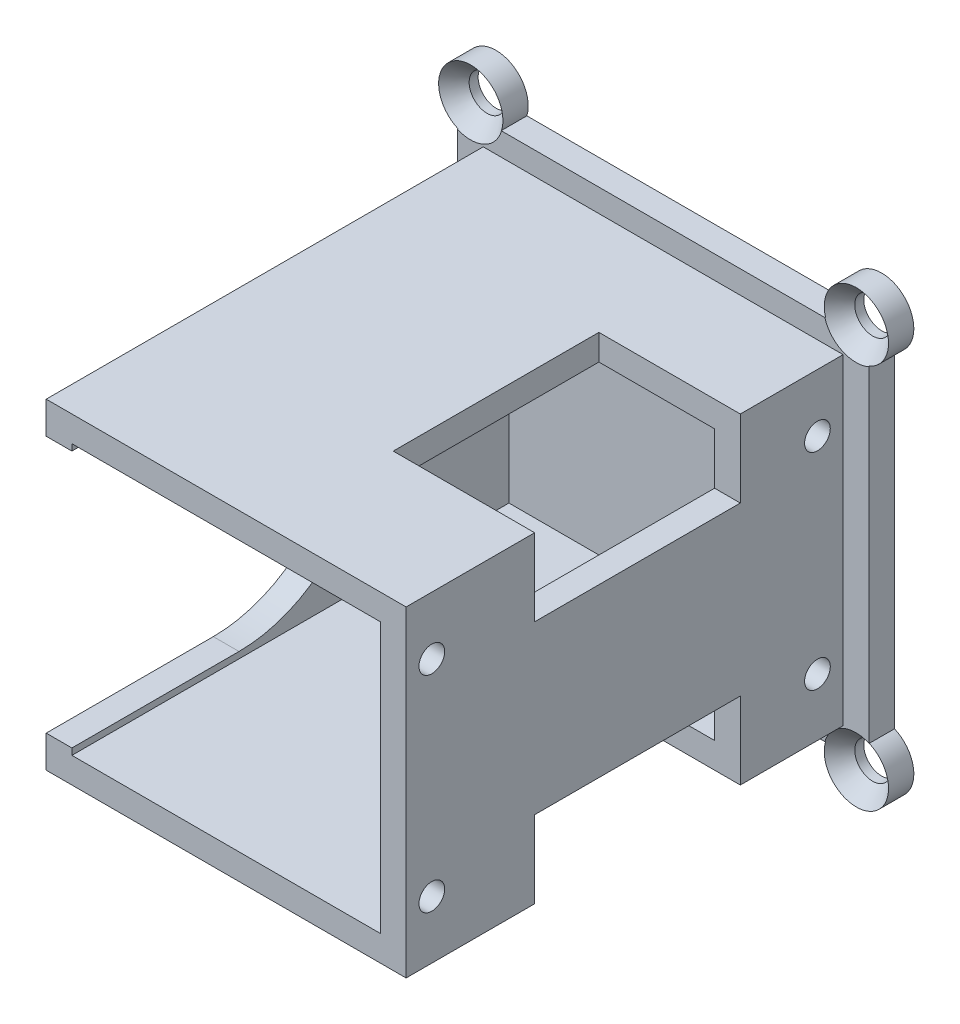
ISO-10303-21;
HEADER;
FILE_DESCRIPTION(('STEP AP214'),'2;1');
FILE_NAME('part.step','',(''),(''),'','','');
FILE_SCHEMA(('AUTOMOTIVE_DESIGN { 1 0 10303 214 1 1 1 1 }'));
ENDSEC;
DATA;
#1=APPLICATION_CONTEXT('core data for automotive mechanical design processes');
#2=APPLICATION_PROTOCOL_DEFINITION('international standard','automotive_design',2000,#1);
#3=PRODUCT_CONTEXT('',#1,'mechanical');
#4=PRODUCT('Part','Part','',(#3));
#5=PRODUCT_RELATED_PRODUCT_CATEGORY('part','',(#4));
#6=PRODUCT_DEFINITION_FORMATION('','',#4);
#7=PRODUCT_DEFINITION_CONTEXT('part definition',#1,'design');
#8=PRODUCT_DEFINITION('design','',#6,#7);
#9=PRODUCT_DEFINITION_SHAPE('','',#8);
#10=(LENGTH_UNIT() NAMED_UNIT(*) SI_UNIT(.MILLI.,.METRE.));
#11=(NAMED_UNIT(*) PLANE_ANGLE_UNIT() SI_UNIT($,.RADIAN.));
#12=(NAMED_UNIT(*) SI_UNIT($,.STERADIAN.) SOLID_ANGLE_UNIT());
#13=UNCERTAINTY_MEASURE_WITH_UNIT(LENGTH_MEASURE(1.E-05),#10,'distance_accuracy_value','');
#14=(GEOMETRIC_REPRESENTATION_CONTEXT(3) GLOBAL_UNCERTAINTY_ASSIGNED_CONTEXT((#13)) GLOBAL_UNIT_ASSIGNED_CONTEXT((#10,
#11,#12)) REPRESENTATION_CONTEXT('',''));
#15=CARTESIAN_POINT('',(0.,0.,0.));
#16=DIRECTION('',(0.,0.,1.));
#17=DIRECTION('',(1.,0.,0.));
#18=AXIS2_PLACEMENT_3D('',#15,#16,#17);
#19=CARTESIAN_POINT('',(14.,-12.5,36.));
#20=DIRECTION('',(-1.,0.,0.));
#21=DIRECTION('',(0.,0.,1.));
#22=AXIS2_PLACEMENT_3D('',#19,#20,#21);
#23=PLANE('',#22);
#24=CARTESIAN_POINT('',(14.,-8.,34.));
#25=DIRECTION('',(1.,0.,0.));
#26=DIRECTION('',(0.,0.,-1.));
#27=AXIS2_PLACEMENT_3D('',#24,#25,#26);
#28=CIRCLE('',#27,0.999999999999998);
#29=CARTESIAN_POINT('',(14.,-8.,33.));
#30=VERTEX_POINT('',#29);
#31=EDGE_CURVE('E508',#30,#30,#28,.T.);
#32=ORIENTED_EDGE('',*,*,#31,.F.);
#33=EDGE_LOOP('',(#32));
#34=FACE_BOUND('',#33,.T.);
#35=CARTESIAN_POINT('',(14.,8.01744345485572,3.99999999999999));
#36=DIRECTION('',(1.,0.,0.));
#37=DIRECTION('',(0.,0.,-1.));
#38=AXIS2_PLACEMENT_3D('',#35,#36,#37);
#39=CIRCLE('',#38,0.999999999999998);
#40=CARTESIAN_POINT('',(14.,8.01744345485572,3.));
#41=VERTEX_POINT('',#40);
#42=EDGE_CURVE('E512',#41,#41,#39,.T.);
#43=ORIENTED_EDGE('',*,*,#42,.F.);
#44=EDGE_LOOP('',(#43));
#45=FACE_BOUND('',#44,.T.);
#46=CARTESIAN_POINT('',(14.,-8.01744345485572,3.99999999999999));
#47=DIRECTION('',(1.,0.,0.));
#48=DIRECTION('',(0.,0.,1.));
#49=AXIS2_PLACEMENT_3D('',#46,#47,#48);
#50=CIRCLE('',#49,0.999999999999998);
#51=CARTESIAN_POINT('',(14.,-8.01744345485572,4.99999999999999));
#52=VERTEX_POINT('',#51);
#53=EDGE_CURVE('E516',#52,#52,#50,.T.);
#54=ORIENTED_EDGE('',*,*,#53,.F.);
#55=EDGE_LOOP('',(#54));
#56=FACE_BOUND('',#55,.T.);
#57=CARTESIAN_POINT('',(14.,8.,34.));
#58=DIRECTION('',(1.,0.,0.));
#59=DIRECTION('',(0.,0.,-1.));
#60=AXIS2_PLACEMENT_3D('',#57,#58,#59);
#61=CIRCLE('',#60,0.999999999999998);
#62=CARTESIAN_POINT('',(14.,8.,33.));
#63=VERTEX_POINT('',#62);
#64=EDGE_CURVE('E520',#63,#63,#61,.T.);
#65=ORIENTED_EDGE('',*,*,#64,.F.);
#66=EDGE_LOOP('',(#65));
#67=FACE_BOUND('',#66,.T.);
#68=DIRECTION('',(0.,1.,0.));
#69=VECTOR('',#68,1.);
#70=CARTESIAN_POINT('',(14.,-12.5,26.));
#71=LINE('',#70,#69);
#72=CARTESIAN_POINT('',(14.,-12.5,26.));
#73=VERTEX_POINT('',#72);
#74=CARTESIAN_POINT('',(14.,-6.5,26.));
#75=VERTEX_POINT('',#74);
#76=EDGE_CURVE('E524',#73,#75,#71,.T.);
#77=ORIENTED_EDGE('',*,*,#76,.T.);
#78=DIRECTION('',(0.,0.,-1.));
#79=VECTOR('',#78,1.);
#80=CARTESIAN_POINT('',(14.,-6.5,36.));
#81=LINE('',#80,#79);
#82=CARTESIAN_POINT('',(14.,-6.5,10.));
#83=VERTEX_POINT('',#82);
#84=EDGE_CURVE('E526',#75,#83,#81,.T.);
#85=ORIENTED_EDGE('',*,*,#84,.T.);
#86=DIRECTION('',(0.,-1.,0.));
#87=VECTOR('',#86,1.);
#88=CARTESIAN_POINT('',(14.,-12.5,10.));
#89=LINE('',#88,#87);
#90=CARTESIAN_POINT('',(14.,-12.5,10.));
#91=VERTEX_POINT('',#90);
#92=EDGE_CURVE('E295',#83,#91,#89,.T.);
#93=ORIENTED_EDGE('',*,*,#92,.T.);
#94=DIRECTION('',(0.,0.,-1.));
#95=VECTOR('',#94,1.);
#96=CARTESIAN_POINT('',(14.,-12.5,36.));
#97=LINE('',#96,#95);
#98=CARTESIAN_POINT('',(14.,-12.5,2.));
#99=VERTEX_POINT('',#98);
#100=EDGE_CURVE('E300',#91,#99,#97,.T.);
#101=ORIENTED_EDGE('',*,*,#100,.T.);
#102=DIRECTION('',(0.,-1.,0.));
#103=VECTOR('',#102,1.);
#104=CARTESIAN_POINT('',(14.,-12.5,2.));
#105=LINE('',#104,#103);
#106=CARTESIAN_POINT('',(14.,12.5,2.));
#107=VERTEX_POINT('',#106);
#108=EDGE_CURVE('E719',#107,#99,#105,.T.);
#109=ORIENTED_EDGE('',*,*,#108,.F.);
#110=DIRECTION('',(0.,0.,-1.));
#111=VECTOR('',#110,1.);
#112=CARTESIAN_POINT('',(14.,12.5,36.));
#113=LINE('',#112,#111);
#114=CARTESIAN_POINT('',(14.,12.5,10.));
#115=VERTEX_POINT('',#114);
#116=EDGE_CURVE('E645',#115,#107,#113,.T.);
#117=ORIENTED_EDGE('',*,*,#116,.F.);
#118=DIRECTION('',(0.,1.,0.));
#119=VECTOR('',#118,1.);
#120=CARTESIAN_POINT('',(14.,-12.5,10.));
#121=LINE('',#120,#119);
#122=CARTESIAN_POINT('',(14.,6.5,10.));
#123=VERTEX_POINT('',#122);
#124=EDGE_CURVE('E328',#123,#115,#121,.T.);
#125=ORIENTED_EDGE('',*,*,#124,.F.);
#126=DIRECTION('',(0.,0.,-1.));
#127=VECTOR('',#126,1.);
#128=CARTESIAN_POINT('',(14.,6.5,36.));
#129=LINE('',#128,#127);
#130=CARTESIAN_POINT('',(14.,6.5,26.));
#131=VERTEX_POINT('',#130);
#132=EDGE_CURVE('E339',#131,#123,#129,.T.);
#133=ORIENTED_EDGE('',*,*,#132,.F.);
#134=DIRECTION('',(0.,-1.,0.));
#135=VECTOR('',#134,1.);
#136=CARTESIAN_POINT('',(14.,-12.5,26.));
#137=LINE('',#136,#135);
#138=CARTESIAN_POINT('',(14.,12.5,26.));
#139=VERTEX_POINT('',#138);
#140=EDGE_CURVE('E322',#139,#131,#137,.T.);
#141=ORIENTED_EDGE('',*,*,#140,.F.);
#142=CARTESIAN_POINT('',(14.,12.5,36.));
#143=VERTEX_POINT('',#142);
#144=EDGE_CURVE('E646',#143,#139,#113,.T.);
#145=ORIENTED_EDGE('',*,*,#144,.F.);
#146=DIRECTION('',(0.,1.,0.));
#147=VECTOR('',#146,1.);
#148=CARTESIAN_POINT('',(14.,-12.5,36.));
#149=LINE('',#148,#147);
#150=CARTESIAN_POINT('',(14.,-12.5,36.));
#151=VERTEX_POINT('',#150);
#152=EDGE_CURVE('E614',#151,#143,#149,.T.);
#153=ORIENTED_EDGE('',*,*,#152,.F.);
#154=EDGE_CURVE('E529',#151,#73,#97,.T.);
#155=ORIENTED_EDGE('',*,*,#154,.T.);
#156=EDGE_LOOP('',(#77,#85,#93,#101,#109,#117,#125,#133,#141,#145,#153,#155));
#157=FACE_BOUND('',#156,.T.);
#158=ADVANCED_FACE('F45',(#34,#45,#56,#67,#157),#23,.F.);
#159=CARTESIAN_POINT('',(-14.,-12.5,36.));
#160=DIRECTION('',(0.,1.,0.));
#161=DIRECTION('',(0.,0.,1.));
#162=AXIS2_PLACEMENT_3D('',#159,#160,#161);
#163=PLANE('',#162);
#164=DIRECTION('',(1.,0.,0.));
#165=VECTOR('',#164,1.);
#166=CARTESIAN_POINT('',(3.,-12.5,26.));
#167=LINE('',#166,#165);
#168=CARTESIAN_POINT('',(3.,-12.5,26.));
#169=VERTEX_POINT('',#168);
#170=EDGE_CURVE('E62',#169,#73,#167,.T.);
#171=ORIENTED_EDGE('',*,*,#170,.T.);
#172=ORIENTED_EDGE('',*,*,#154,.F.);
#173=DIRECTION('',(1.,0.,0.));
#174=VECTOR('',#173,1.);
#175=CARTESIAN_POINT('',(-14.,-12.5,36.));
#176=LINE('',#175,#174);
#177=CARTESIAN_POINT('',(-14.,-12.5,36.));
#178=VERTEX_POINT('',#177);
#179=EDGE_CURVE('E633',#178,#151,#176,.T.);
#180=ORIENTED_EDGE('',*,*,#179,.F.);
#181=DIRECTION('',(0.,0.,-1.));
#182=VECTOR('',#181,1.);
#183=CARTESIAN_POINT('',(-14.,-12.5,36.));
#184=LINE('',#183,#182);
#185=CARTESIAN_POINT('',(-14.,-12.5,2.));
#186=VERTEX_POINT('',#185);
#187=EDGE_CURVE('E638',#178,#186,#184,.T.);
#188=ORIENTED_EDGE('',*,*,#187,.T.);
#189=DIRECTION('',(-1.,0.,0.));
#190=VECTOR('',#189,1.);
#191=CARTESIAN_POINT('',(-14.,-12.5,2.));
#192=LINE('',#191,#190);
#193=EDGE_CURVE('E654',#99,#186,#192,.T.);
#194=ORIENTED_EDGE('',*,*,#193,.F.);
#195=ORIENTED_EDGE('',*,*,#100,.F.);
#196=DIRECTION('',(1.,0.,0.));
#197=VECTOR('',#196,1.);
#198=CARTESIAN_POINT('',(3.,-12.5,10.));
#199=LINE('',#198,#197);
#200=CARTESIAN_POINT('',(3.,-12.5,10.));
#201=VERTEX_POINT('',#200);
#202=EDGE_CURVE('E282',#201,#91,#199,.T.);
#203=ORIENTED_EDGE('',*,*,#202,.F.);
#204=DIRECTION('',(0.,0.,1.));
#205=VECTOR('',#204,1.);
#206=CARTESIAN_POINT('',(3.,-12.5,36.));
#207=LINE('',#206,#205);
#208=EDGE_CURVE('E291',#201,#169,#207,.T.);
#209=ORIENTED_EDGE('',*,*,#208,.T.);
#210=EDGE_LOOP('',(#171,#172,#180,#188,#194,#195,#203,#209));
#211=FACE_BOUND('',#210,.T.);
#212=ADVANCED_FACE('F298',(#211),#163,.F.);
#213=CARTESIAN_POINT('',(12.,-10.5,36.));
#214=DIRECTION('',(-1.,0.,0.));
#215=DIRECTION('',(0.,0.,1.));
#216=AXIS2_PLACEMENT_3D('',#213,#214,#215);
#217=PLANE('',#216);
#218=CARTESIAN_POINT('',(12.,-8.,34.));
#219=DIRECTION('',(-1.,0.,0.));
#220=DIRECTION('',(0.,0.,1.));
#221=AXIS2_PLACEMENT_3D('',#218,#219,#220);
#222=CIRCLE('',#221,0.999999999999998);
#223=CARTESIAN_POINT('',(12.,-8.,35.));
#224=VERTEX_POINT('',#223);
#225=EDGE_CURVE('E48',#224,#224,#222,.T.);
#226=ORIENTED_EDGE('',*,*,#225,.F.);
#227=EDGE_LOOP('',(#226));
#228=FACE_BOUND('',#227,.T.);
#229=CARTESIAN_POINT('',(12.,8.01744345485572,3.99999999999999));
#230=DIRECTION('',(-1.,0.,0.));
#231=DIRECTION('',(0.,0.,1.));
#232=AXIS2_PLACEMENT_3D('',#229,#230,#231);
#233=CIRCLE('',#232,0.999999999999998);
#234=CARTESIAN_POINT('',(12.,8.01744345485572,4.99999999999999));
#235=VERTEX_POINT('',#234);
#236=EDGE_CURVE('E535',#235,#235,#233,.T.);
#237=ORIENTED_EDGE('',*,*,#236,.F.);
#238=EDGE_LOOP('',(#237));
#239=FACE_BOUND('',#238,.T.);
#240=CARTESIAN_POINT('',(12.,-8.01744345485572,3.99999999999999));
#241=DIRECTION('',(-1.,0.,0.));
#242=DIRECTION('',(0.,0.,1.));
#243=AXIS2_PLACEMENT_3D('',#240,#241,#242);
#244=CIRCLE('',#243,0.999999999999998);
#245=CARTESIAN_POINT('',(12.,-8.01744345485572,4.99999999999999));
#246=VERTEX_POINT('',#245);
#247=EDGE_CURVE('E698',#246,#246,#244,.T.);
#248=ORIENTED_EDGE('',*,*,#247,.F.);
#249=EDGE_LOOP('',(#248));
#250=FACE_BOUND('',#249,.T.);
#251=CARTESIAN_POINT('',(12.,8.,34.));
#252=DIRECTION('',(-1.,0.,0.));
#253=DIRECTION('',(0.,0.,1.));
#254=AXIS2_PLACEMENT_3D('',#251,#252,#253);
#255=CIRCLE('',#254,0.999999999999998);
#256=CARTESIAN_POINT('',(12.,8.,35.));
#257=VERTEX_POINT('',#256);
#258=EDGE_CURVE('E541',#257,#257,#255,.T.);
#259=ORIENTED_EDGE('',*,*,#258,.F.);
#260=EDGE_LOOP('',(#259));
#261=FACE_BOUND('',#260,.T.);
#262=DIRECTION('',(0.,0.,1.));
#263=VECTOR('',#262,1.);
#264=CARTESIAN_POINT('',(12.,-6.5,36.));
#265=LINE('',#264,#263);
#266=CARTESIAN_POINT('',(12.,-6.5,10.));
#267=VERTEX_POINT('',#266);
#268=CARTESIAN_POINT('',(12.,-6.5,26.));
#269=VERTEX_POINT('',#268);
#270=EDGE_CURVE('E11',#267,#269,#265,.T.);
#271=ORIENTED_EDGE('',*,*,#270,.T.);
#272=DIRECTION('',(0.,-1.,0.));
#273=VECTOR('',#272,1.);
#274=CARTESIAN_POINT('',(12.,-10.5,26.));
#275=LINE('',#274,#273);
#276=CARTESIAN_POINT('',(12.,-10.5,26.));
#277=VERTEX_POINT('',#276);
#278=EDGE_CURVE('E318',#269,#277,#275,.T.);
#279=ORIENTED_EDGE('',*,*,#278,.T.);
#280=DIRECTION('',(0.,0.,-1.));
#281=VECTOR('',#280,1.);
#282=CARTESIAN_POINT('',(12.,-10.5,36.));
#283=LINE('',#282,#281);
#284=CARTESIAN_POINT('',(12.,-10.5,36.));
#285=VERTEX_POINT('',#284);
#286=EDGE_CURVE('E711',#285,#277,#283,.T.);
#287=ORIENTED_EDGE('',*,*,#286,.F.);
#288=DIRECTION('',(0.,1.,0.));
#289=VECTOR('',#288,1.);
#290=CARTESIAN_POINT('',(12.,-10.5,36.));
#291=LINE('',#290,#289);
#292=CARTESIAN_POINT('',(12.,10.5,36.));
#293=VERTEX_POINT('',#292);
#294=EDGE_CURVE('E611',#285,#293,#291,.T.);
#295=ORIENTED_EDGE('',*,*,#294,.T.);
#296=DIRECTION('',(0.,0.,-1.));
#297=VECTOR('',#296,1.);
#298=CARTESIAN_POINT('',(12.,10.5,36.));
#299=LINE('',#298,#297);
#300=CARTESIAN_POINT('',(12.,10.5,26.));
#301=VERTEX_POINT('',#300);
#302=EDGE_CURVE('E608',#293,#301,#299,.T.);
#303=ORIENTED_EDGE('',*,*,#302,.T.);
#304=DIRECTION('',(0.,1.,0.));
#305=VECTOR('',#304,1.);
#306=CARTESIAN_POINT('',(12.,-10.5,26.));
#307=LINE('',#306,#305);
#308=CARTESIAN_POINT('',(12.,6.5,26.));
#309=VERTEX_POINT('',#308);
#310=EDGE_CURVE('E349',#309,#301,#307,.T.);
#311=ORIENTED_EDGE('',*,*,#310,.F.);
#312=DIRECTION('',(0.,0.,1.));
#313=VECTOR('',#312,1.);
#314=CARTESIAN_POINT('',(12.,6.5,36.));
#315=LINE('',#314,#313);
#316=CARTESIAN_POINT('',(12.,6.5,10.));
#317=VERTEX_POINT('',#316);
#318=EDGE_CURVE('E593',#317,#309,#315,.T.);
#319=ORIENTED_EDGE('',*,*,#318,.F.);
#320=DIRECTION('',(0.,-1.,0.));
#321=VECTOR('',#320,1.);
#322=CARTESIAN_POINT('',(12.,-10.5,10.));
#323=LINE('',#322,#321);
#324=CARTESIAN_POINT('',(12.,10.5,10.));
#325=VERTEX_POINT('',#324);
#326=EDGE_CURVE('E360',#325,#317,#323,.T.);
#327=ORIENTED_EDGE('',*,*,#326,.F.);
#328=CARTESIAN_POINT('',(12.,10.5,2.));
#329=VERTEX_POINT('',#328);
#330=EDGE_CURVE('E615',#325,#329,#299,.T.);
#331=ORIENTED_EDGE('',*,*,#330,.T.);
#332=DIRECTION('',(0.,-1.,0.));
#333=VECTOR('',#332,1.);
#334=CARTESIAN_POINT('',(12.,-10.5,2.));
#335=LINE('',#334,#333);
#336=CARTESIAN_POINT('',(12.,-10.5,2.));
#337=VERTEX_POINT('',#336);
#338=EDGE_CURVE('E789',#329,#337,#335,.T.);
#339=ORIENTED_EDGE('',*,*,#338,.T.);
#340=CARTESIAN_POINT('',(12.,-10.5,10.));
#341=VERTEX_POINT('',#340);
#342=EDGE_CURVE('E806',#341,#337,#283,.T.);
#343=ORIENTED_EDGE('',*,*,#342,.F.);
#344=DIRECTION('',(0.,1.,0.));
#345=VECTOR('',#344,1.);
#346=CARTESIAN_POINT('',(12.,-10.5,10.));
#347=LINE('',#346,#345);
#348=EDGE_CURVE('E314',#341,#267,#347,.T.);
#349=ORIENTED_EDGE('',*,*,#348,.T.);
#350=EDGE_LOOP('',(#271,#279,#287,#295,#303,#311,#319,#327,#331,#339,#343,#349));
#351=FACE_BOUND('',#350,.T.);
#352=ADVANCED_FACE('F469',(#228,#239,#250,#261,#351),#217,.T.);
#353=CARTESIAN_POINT('',(-12.,-10.5,36.));
#354=DIRECTION('',(0.,1.,0.));
#355=DIRECTION('',(0.,0.,1.));
#356=AXIS2_PLACEMENT_3D('',#353,#354,#355);
#357=PLANE('',#356);
#358=ORIENTED_EDGE('',*,*,#286,.T.);
#359=DIRECTION('',(-1.,0.,0.));
#360=VECTOR('',#359,1.);
#361=CARTESIAN_POINT('',(-12.,-10.5,26.));
#362=LINE('',#361,#360);
#363=CARTESIAN_POINT('',(3.,-10.5,26.));
#364=VERTEX_POINT('',#363);
#365=EDGE_CURVE('E54',#277,#364,#362,.T.);
#366=ORIENTED_EDGE('',*,*,#365,.T.);
#367=DIRECTION('',(0.,0.,1.));
#368=VECTOR('',#367,1.);
#369=CARTESIAN_POINT('',(3.,-10.5,36.));
#370=LINE('',#369,#368);
#371=CARTESIAN_POINT('',(3.,-10.5,10.));
#372=VERTEX_POINT('',#371);
#373=EDGE_CURVE('E599',#372,#364,#370,.T.);
#374=ORIENTED_EDGE('',*,*,#373,.F.);
#375=DIRECTION('',(1.,0.,0.));
#376=VECTOR('',#375,1.);
#377=CARTESIAN_POINT('',(-12.,-10.5,10.));
#378=LINE('',#377,#376);
#379=EDGE_CURVE('E285',#372,#341,#378,.T.);
#380=ORIENTED_EDGE('',*,*,#379,.T.);
#381=ORIENTED_EDGE('',*,*,#342,.T.);
#382=DIRECTION('',(-1.,0.,0.));
#383=VECTOR('',#382,1.);
#384=CARTESIAN_POINT('',(-12.,-10.5,2.));
#385=LINE('',#384,#383);
#386=CARTESIAN_POINT('',(-12.,-10.5,2.));
#387=VERTEX_POINT('',#386);
#388=EDGE_CURVE('E650',#337,#387,#385,.T.);
#389=ORIENTED_EDGE('',*,*,#388,.T.);
#390=DIRECTION('',(0.,0.,-1.));
#391=VECTOR('',#390,1.);
#392=CARTESIAN_POINT('',(-12.,-10.5,36.));
#393=LINE('',#392,#391);
#394=CARTESIAN_POINT('',(-12.,-10.5,36.));
#395=VERTEX_POINT('',#394);
#396=EDGE_CURVE('E808',#395,#387,#393,.T.);
#397=ORIENTED_EDGE('',*,*,#396,.F.);
#398=DIRECTION('',(1.,0.,0.));
#399=VECTOR('',#398,1.);
#400=CARTESIAN_POINT('',(-12.,-10.5,36.));
#401=LINE('',#400,#399);
#402=EDGE_CURVE('E803',#395,#285,#401,.T.);
#403=ORIENTED_EDGE('',*,*,#402,.T.);
#404=EDGE_LOOP('',(#358,#366,#374,#380,#381,#389,#397,#403));
#405=FACE_BOUND('',#404,.T.);
#406=ADVANCED_FACE('F465',(#405),#357,.T.);
#407=CARTESIAN_POINT('',(0.,0.,0.));
#408=DIRECTION('',(0.,0.,-1.));
#409=DIRECTION('',(-1.,0.,0.));
#410=AXIS2_PLACEMENT_3D('',#407,#408,#409);
#411=PLANE('',#410);
#412=CARTESIAN_POINT('',(-15.,-15.,0.));
#413=DIRECTION('',(0.,0.,1.));
#414=DIRECTION('',(1.,0.,0.));
#415=AXIS2_PLACEMENT_3D('',#412,#413,#414);
#416=CIRCLE('',#415,1.397);
#417=CARTESIAN_POINT('',(-13.603,-15.,0.));
#418=VERTEX_POINT('',#417);
#419=EDGE_CURVE('E945',#418,#418,#416,.T.);
#420=ORIENTED_EDGE('',*,*,#419,.T.);
#421=EDGE_LOOP('',(#420));
#422=FACE_BOUND('',#421,.T.);
#423=DIRECTION('',(-1.,0.,0.));
#424=VECTOR('',#423,1.);
#425=CARTESIAN_POINT('',(-16.,14.2857142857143,0.));
#426=LINE('',#425,#424);
#427=CARTESIAN_POINT('',(12.6042128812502,14.2857142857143,0.));
#428=VERTEX_POINT('',#427);
#429=CARTESIAN_POINT('',(-12.6042128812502,14.2857142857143,0.));
#430=VERTEX_POINT('',#429);
#431=EDGE_CURVE('E843',#428,#430,#426,.T.);
#432=ORIENTED_EDGE('',*,*,#431,.F.);
#433=CARTESIAN_POINT('',(15.,15.,0.));
#434=DIRECTION('',(0.,0.,1.));
#435=DIRECTION('',(-1.,0.,0.));
#436=AXIS2_PLACEMENT_3D('',#433,#434,#435);
#437=CIRCLE('',#436,2.5);
#438=CARTESIAN_POINT('',(16.,12.7087121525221,0.));
#439=VERTEX_POINT('',#438);
#440=EDGE_CURVE('E970',#439,#428,#437,.T.);
#441=ORIENTED_EDGE('',*,*,#440,.F.);
#442=DIRECTION('',(0.,1.,0.));
#443=VECTOR('',#442,1.);
#444=CARTESIAN_POINT('',(16.,-14.2857142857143,0.));
#445=LINE('',#444,#443);
#446=CARTESIAN_POINT('',(16.,-12.7087121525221,0.));
#447=VERTEX_POINT('',#446);
#448=EDGE_CURVE('E846',#447,#439,#445,.T.);
#449=ORIENTED_EDGE('',*,*,#448,.F.);
#450=CARTESIAN_POINT('',(15.,-15.,0.));
#451=DIRECTION('',(0.,0.,-1.));
#452=DIRECTION('',(-1.,0.,0.));
#453=AXIS2_PLACEMENT_3D('',#450,#451,#452);
#454=CIRCLE('',#453,2.5);
#455=CARTESIAN_POINT('',(12.6042128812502,-14.2857142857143,0.));
#456=VERTEX_POINT('',#455);
#457=EDGE_CURVE('E928',#447,#456,#454,.T.);
#458=ORIENTED_EDGE('',*,*,#457,.T.);
#459=DIRECTION('',(1.,0.,0.));
#460=VECTOR('',#459,1.);
#461=CARTESIAN_POINT('',(-16.,-14.2857142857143,0.));
#462=LINE('',#461,#460);
#463=CARTESIAN_POINT('',(-12.6042128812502,-14.2857142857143,0.));
#464=VERTEX_POINT('',#463);
#465=EDGE_CURVE('E739',#464,#456,#462,.T.);
#466=ORIENTED_EDGE('',*,*,#465,.F.);
#467=CARTESIAN_POINT('',(-15.,-15.,0.));
#468=DIRECTION('',(0.,0.,1.));
#469=DIRECTION('',(1.,0.,0.));
#470=AXIS2_PLACEMENT_3D('',#467,#468,#469);
#471=CIRCLE('',#470,2.5);
#472=CARTESIAN_POINT('',(-16.,-12.7087121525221,0.));
#473=VERTEX_POINT('',#472);
#474=EDGE_CURVE('E866',#473,#464,#471,.T.);
#475=ORIENTED_EDGE('',*,*,#474,.F.);
#476=DIRECTION('',(0.,-1.,0.));
#477=VECTOR('',#476,1.);
#478=CARTESIAN_POINT('',(-16.,-14.2857142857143,0.));
#479=LINE('',#478,#477);
#480=CARTESIAN_POINT('',(-16.,12.7087121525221,0.));
#481=VERTEX_POINT('',#480);
#482=EDGE_CURVE('E840',#481,#473,#479,.T.);
#483=ORIENTED_EDGE('',*,*,#482,.F.);
#484=CARTESIAN_POINT('',(-15.,15.,0.));
#485=DIRECTION('',(0.,0.,-1.));
#486=DIRECTION('',(1.,0.,0.));
#487=AXIS2_PLACEMENT_3D('',#484,#485,#486);
#488=CIRCLE('',#487,2.5);
#489=EDGE_CURVE('E920',#481,#430,#488,.T.);
#490=ORIENTED_EDGE('',*,*,#489,.T.);
#491=EDGE_LOOP('',(#432,#441,#449,#458,#466,#475,#483,#490));
#492=FACE_BOUND('',#491,.T.);
#493=CARTESIAN_POINT('',(-15.,15.,0.));
#494=DIRECTION('',(0.,0.,1.));
#495=DIRECTION('',(1.,0.,0.));
#496=AXIS2_PLACEMENT_3D('',#493,#494,#495);
#497=CIRCLE('',#496,1.397);
#498=CARTESIAN_POINT('',(-13.603,15.,0.));
#499=VERTEX_POINT('',#498);
#500=EDGE_CURVE('E1035',#499,#499,#497,.T.);
#501=ORIENTED_EDGE('',*,*,#500,.T.);
#502=EDGE_LOOP('',(#501));
#503=FACE_BOUND('',#502,.T.);
#504=CARTESIAN_POINT('',(15.,-15.,0.));
#505=DIRECTION('',(0.,0.,1.));
#506=DIRECTION('',(1.,0.,0.));
#507=AXIS2_PLACEMENT_3D('',#504,#505,#506);
#508=CIRCLE('',#507,1.397);
#509=CARTESIAN_POINT('',(16.397,-15.,0.));
#510=VERTEX_POINT('',#509);
#511=EDGE_CURVE('E1006',#510,#510,#508,.T.);
#512=ORIENTED_EDGE('',*,*,#511,.T.);
#513=EDGE_LOOP('',(#512));
#514=FACE_BOUND('',#513,.T.);
#515=CARTESIAN_POINT('',(15.,15.,0.));
#516=DIRECTION('',(0.,0.,1.));
#517=DIRECTION('',(1.,0.,0.));
#518=AXIS2_PLACEMENT_3D('',#515,#516,#517);
#519=CIRCLE('',#518,1.397);
#520=CARTESIAN_POINT('',(16.397,15.,0.));
#521=VERTEX_POINT('',#520);
#522=EDGE_CURVE('E370',#521,#521,#519,.T.);
#523=ORIENTED_EDGE('',*,*,#522,.T.);
#524=EDGE_LOOP('',(#523));
#525=FACE_BOUND('',#524,.T.);
#526=ADVANCED_FACE('F468',(#422,#492,#503,#514,#525),#411,.T.);
#527=CARTESIAN_POINT('',(0.,0.,2.));
#528=DIRECTION('',(0.,0.,-1.));
#529=DIRECTION('',(-1.,0.,0.));
#530=AXIS2_PLACEMENT_3D('',#527,#528,#529);
#531=PLANE('',#530);
#532=DIRECTION('',(0.,1.,0.));
#533=VECTOR('',#532,1.);
#534=CARTESIAN_POINT('',(-14.,-12.5,2.));
#535=LINE('',#534,#533);
#536=CARTESIAN_POINT('',(-14.,12.5,2.));
#537=VERTEX_POINT('',#536);
#538=EDGE_CURVE('E730',#186,#537,#535,.T.);
#539=ORIENTED_EDGE('',*,*,#538,.T.);
#540=DIRECTION('',(1.,0.,0.));
#541=VECTOR('',#540,1.);
#542=CARTESIAN_POINT('',(-14.,12.5,2.));
#543=LINE('',#542,#541);
#544=EDGE_CURVE('E728',#537,#107,#543,.T.);
#545=ORIENTED_EDGE('',*,*,#544,.T.);
#546=ORIENTED_EDGE('',*,*,#108,.T.);
#547=ORIENTED_EDGE('',*,*,#193,.T.);
#548=EDGE_LOOP('',(#539,#545,#546,#547));
#549=FACE_BOUND('',#548,.T.);
#550=CARTESIAN_POINT('',(15.,15.,2.));
#551=DIRECTION('',(0.,0.,1.));
#552=DIRECTION('',(1.,0.,0.));
#553=AXIS2_PLACEMENT_3D('',#550,#551,#552);
#554=CIRCLE('',#553,2.5273);
#555=CARTESIAN_POINT('',(12.5757390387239,14.2857142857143,2.));
#556=VERTEX_POINT('',#555);
#557=CARTESIAN_POINT('',(16.,12.6789559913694,2.));
#558=VERTEX_POINT('',#557);
#559=EDGE_CURVE('E363',#556,#558,#554,.T.);
#560=ORIENTED_EDGE('',*,*,#559,.F.);
#561=DIRECTION('',(-1.,0.,0.));
#562=VECTOR('',#561,1.);
#563=CARTESIAN_POINT('',(-16.,14.2857142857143,2.));
#564=LINE('',#563,#562);
#565=CARTESIAN_POINT('',(-12.5757390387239,14.2857142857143,2.));
#566=VERTEX_POINT('',#565);
#567=EDGE_CURVE('E853',#556,#566,#564,.T.);
#568=ORIENTED_EDGE('',*,*,#567,.T.);
#569=CARTESIAN_POINT('',(-15.,15.,2.));
#570=DIRECTION('',(0.,0.,1.));
#571=DIRECTION('',(1.,0.,0.));
#572=AXIS2_PLACEMENT_3D('',#569,#570,#571);
#573=CIRCLE('',#572,2.5273);
#574=CARTESIAN_POINT('',(-16.,12.6789559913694,2.));
#575=VERTEX_POINT('',#574);
#576=EDGE_CURVE('E436',#575,#566,#573,.T.);
#577=ORIENTED_EDGE('',*,*,#576,.F.);
#578=DIRECTION('',(0.,-1.,0.));
#579=VECTOR('',#578,1.);
#580=CARTESIAN_POINT('',(-16.,-14.2857142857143,2.));
#581=LINE('',#580,#579);
#582=CARTESIAN_POINT('',(-16.,-12.6789559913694,2.));
#583=VERTEX_POINT('',#582);
#584=EDGE_CURVE('E736',#575,#583,#581,.T.);
#585=ORIENTED_EDGE('',*,*,#584,.T.);
#586=CARTESIAN_POINT('',(-15.,-15.,2.));
#587=DIRECTION('',(0.,0.,1.));
#588=DIRECTION('',(1.,0.,0.));
#589=AXIS2_PLACEMENT_3D('',#586,#587,#588);
#590=CIRCLE('',#589,2.5273);
#591=CARTESIAN_POINT('',(-12.5757390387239,-14.2857142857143,2.));
#592=VERTEX_POINT('',#591);
#593=EDGE_CURVE('E938',#592,#583,#590,.T.);
#594=ORIENTED_EDGE('',*,*,#593,.F.);
#595=DIRECTION('',(1.,0.,0.));
#596=VECTOR('',#595,1.);
#597=CARTESIAN_POINT('',(-16.,-14.2857142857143,2.));
#598=LINE('',#597,#596);
#599=CARTESIAN_POINT('',(12.5757390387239,-14.2857142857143,2.));
#600=VERTEX_POINT('',#599);
#601=EDGE_CURVE('E731',#592,#600,#598,.T.);
#602=ORIENTED_EDGE('',*,*,#601,.T.);
#603=CARTESIAN_POINT('',(15.,-15.,2.));
#604=DIRECTION('',(0.,0.,1.));
#605=DIRECTION('',(1.,0.,0.));
#606=AXIS2_PLACEMENT_3D('',#603,#604,#605);
#607=CIRCLE('',#606,2.5273);
#608=CARTESIAN_POINT('',(16.,-12.6789559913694,2.));
#609=VERTEX_POINT('',#608);
#610=EDGE_CURVE('E1014',#609,#600,#607,.T.);
#611=ORIENTED_EDGE('',*,*,#610,.F.);
#612=DIRECTION('',(0.,1.,0.));
#613=VECTOR('',#612,1.);
#614=CARTESIAN_POINT('',(16.,-14.2857142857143,2.));
#615=LINE('',#614,#613);
#616=EDGE_CURVE('E839',#609,#558,#615,.T.);
#617=ORIENTED_EDGE('',*,*,#616,.T.);
#618=EDGE_LOOP('',(#560,#568,#577,#585,#594,#602,#611,#617));
#619=FACE_BOUND('',#618,.T.);
#620=ADVANCED_FACE('F444',(#549,#619),#531,.F.);
#621=CARTESIAN_POINT('',(16.,-14.2857142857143,2.));
#622=DIRECTION('',(-1.,0.,0.));
#623=DIRECTION('',(0.,0.,1.));
#624=AXIS2_PLACEMENT_3D('',#621,#622,#623);
#625=PLANE('',#624);
#626=DIRECTION('',(0.,0.,-1.));
#627=VECTOR('',#626,1.);
#628=CARTESIAN_POINT('',(16.,12.7087121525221,2.));
#629=LINE('',#628,#627);
#630=CARTESIAN_POINT('',(16.,12.7087121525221,1.96859494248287));
#631=VERTEX_POINT('',#630);
#632=EDGE_CURVE('E963',#631,#439,#629,.T.);
#633=ORIENTED_EDGE('',*,*,#632,.F.);
#634=CARTESIAN_POINT('',(16.,14.5707988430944,0.344523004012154));
#635=CARTESIAN_POINT('',(16.,14.5369683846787,0.359892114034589));
#636=CARTESIAN_POINT('',(16.,14.5037300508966,0.376486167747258));
#637=CARTESIAN_POINT('',(16.,14.4383587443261,0.411638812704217));
#638=CARTESIAN_POINT('',(16.,14.4062244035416,0.43019484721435));
#639=CARTESIAN_POINT('',(16.,14.3430199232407,0.468752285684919));
#640=CARTESIAN_POINT('',(16.,14.3119461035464,0.488747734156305));
#641=CARTESIAN_POINT('',(16.,14.2505926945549,0.529940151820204));
#642=CARTESIAN_POINT('',(16.,14.2203134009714,0.551137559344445));
#643=CARTESIAN_POINT('',(16.,14.1309203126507,0.615838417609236));
#644=CARTESIAN_POINT('',(16.,14.0728121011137,0.660728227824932));
#645=CARTESIAN_POINT('',(16.,13.9585045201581,0.752979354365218));
#646=CARTESIAN_POINT('',(16.,13.9023076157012,0.800343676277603));
#647=CARTESIAN_POINT('',(16.,13.7972066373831,0.89168854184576));
#648=CARTESIAN_POINT('',(16.,13.7481565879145,0.935501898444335));
#649=CARTESIAN_POINT('',(16.,13.6509703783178,1.02413098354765));
#650=CARTESIAN_POINT('',(16.,13.6028342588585,1.06894675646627));
#651=CARTESIAN_POINT('',(16.,13.4595313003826,1.20448957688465));
#652=CARTESIAN_POINT('',(16.,13.3654332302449,1.29634464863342));
#653=CARTESIAN_POINT('',(16.,13.1785152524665,1.48245929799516));
#654=CARTESIAN_POINT('',(16.,13.0857066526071,1.57673013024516));
#655=CARTESIAN_POINT('',(16.,12.901371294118,1.76652168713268));
#656=CARTESIAN_POINT('',(16.,12.8098445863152,1.86204246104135));
#657=CARTESIAN_POINT('',(16.,12.5776345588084,2.10668809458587));
#658=CARTESIAN_POINT('',(16.,12.4375870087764,2.25641507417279));
#659=CARTESIAN_POINT('',(16.,12.1588580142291,2.55713216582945));
#660=CARTESIAN_POINT('',(16.,12.0201765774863,2.70812228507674));
#661=CARTESIAN_POINT('',(16.,11.745351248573,3.00916494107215));
#662=CARTESIAN_POINT('',(16.,11.6091966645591,3.15920772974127));
#663=CARTESIAN_POINT('',(16.,11.3375455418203,3.4598741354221));
#664=CARTESIAN_POINT('',(16.,11.2020489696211,3.61049772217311));
#665=CARTESIAN_POINT('',(16.,11.0667552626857,3.76130123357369));
#666=B_SPLINE_CURVE_WITH_KNOTS('',3,(#634,#635,#636,#637,#638,#639,#640,#641,#642,#643,#644,
#645,#646,#647,#648,#649,#650,#651,#652,#653,#654,#655,#656,#657,#658,#659,#660,#661,#662,#663,
#664,#665),.UNSPECIFIED.,.F.,.F.,(4,2,2,2,2,2,2,2,2,2,2,2,2,2,2,4),(0.,0.111402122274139,
0.222660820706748,0.333483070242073,0.44434599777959,0.664516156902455,0.884960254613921,
1.08224791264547,1.27954432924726,1.67399028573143,2.07084392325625,2.46771325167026,
3.0827457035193,3.69778165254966,4.30561014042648,4.91340737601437),.UNSPECIFIED.);
#667=EDGE_CURVE('E384',#631,#558,#666,.T.);
#668=ORIENTED_EDGE('',*,*,#667,.T.);
#669=ORIENTED_EDGE('',*,*,#616,.F.);
#670=CARTESIAN_POINT('',(16.,-11.0667552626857,3.76130123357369));
#671=CARTESIAN_POINT('',(16.,-11.2031275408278,3.60929678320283));
#672=CARTESIAN_POINT('',(16.,-11.3397051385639,3.45747427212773));
#673=CARTESIAN_POINT('',(16.,-11.6134208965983,3.15454263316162));
#674=CARTESIAN_POINT('',(16.,-11.7505585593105,3.00343305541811));
#675=CARTESIAN_POINT('',(16.,-12.0253052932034,2.7025331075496));
#676=CARTESIAN_POINT('',(16.,-12.1629114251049,2.55274005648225));
#677=CARTESIAN_POINT('',(16.,-12.4395764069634,2.25428838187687));
#678=CARTESIAN_POINT('',(16.,-12.5786362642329,2.1056306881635));
#679=CARTESIAN_POINT('',(16.,-12.7892737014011,1.88371601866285));
#680=CARTESIAN_POINT('',(16.,-12.8600481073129,1.80969733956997));
#681=CARTESIAN_POINT('',(16.,-13.0023017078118,1.66235986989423));
#682=CARTESIAN_POINT('',(16.,-13.0737807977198,1.58904097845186));
#683=CARTESIAN_POINT('',(16.,-13.217545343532,1.44347691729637));
#684=CARTESIAN_POINT('',(16.,-13.2898289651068,1.37122993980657));
#685=CARTESIAN_POINT('',(16.,-13.435720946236,1.22799969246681));
#686=CARTESIAN_POINT('',(16.,-13.509330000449,1.15701712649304));
#687=CARTESIAN_POINT('',(16.,-13.6588414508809,1.01651926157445));
#688=CARTESIAN_POINT('',(16.,-13.7347556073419,0.94701643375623));
#689=CARTESIAN_POINT('',(16.,-13.8891556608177,0.811109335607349));
#690=CARTESIAN_POINT('',(16.,-13.9676375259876,0.744700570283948));
#691=CARTESIAN_POINT('',(16.,-14.0887229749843,0.648683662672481));
#692=CARTESIAN_POINT('',(16.,-14.1298054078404,0.617166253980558));
#693=CARTESIAN_POINT('',(16.,-14.2132498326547,0.555922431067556));
#694=CARTESIAN_POINT('',(16.,-14.2556109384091,0.526194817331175));
#695=CARTESIAN_POINT('',(16.,-14.3421893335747,0.469012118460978));
#696=CARTESIAN_POINT('',(16.,-14.3864152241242,0.441569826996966));
#697=CARTESIAN_POINT('',(16.,-14.454293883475,0.402987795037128));
#698=CARTESIAN_POINT('',(16.,-14.4772044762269,0.390544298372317));
#699=CARTESIAN_POINT('',(16.,-14.5235791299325,0.366702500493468));
#700=CARTESIAN_POINT('',(16.,-14.5470435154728,0.35530483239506));
#701=CARTESIAN_POINT('',(16.,-14.5707988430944,0.344523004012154));
#702=B_SPLINE_CURVE_WITH_KNOTS('',3,(#670,#671,#672,#673,#674,#675,#676,#677,#678,#679,#680,
#681,#682,#683,#684,#685,#686,#687,#688,#689,#690,#691,#692,#693,#694,#695,#696,#697,#698,#699,
#700,#701),.UNSPECIFIED.,.F.,.F.,(4,2,2,2,2,2,2,2,2,2,2,2,2,2,2,4),(0.,0.612640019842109,
1.22482028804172,1.83502958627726,2.44569418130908,2.75292038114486,3.06010161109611,
3.36668663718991,3.67343731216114,3.98217350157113,4.29044620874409,4.44574970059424,
4.60094792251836,4.75696354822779,4.83515471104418,4.91339290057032),.UNSPECIFIED.);
#703=CARTESIAN_POINT('',(16.,-12.7087121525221,1.96859494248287));
#704=VERTEX_POINT('',#703);
#705=EDGE_CURVE('E427',#609,#704,#702,.T.);
#706=ORIENTED_EDGE('',*,*,#705,.T.);
#707=DIRECTION('',(0.,0.,-1.));
#708=VECTOR('',#707,1.);
#709=CARTESIAN_POINT('',(16.,-12.7087121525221,2.));
#710=LINE('',#709,#708);
#711=EDGE_CURVE('E921',#704,#447,#710,.T.);
#712=ORIENTED_EDGE('',*,*,#711,.T.);
#713=ORIENTED_EDGE('',*,*,#448,.T.);
#714=EDGE_LOOP('',(#633,#668,#669,#706,#712,#713));
#715=FACE_BOUND('',#714,.T.);
#716=ADVANCED_FACE('F440',(#715),#625,.F.);
#717=CARTESIAN_POINT('',(-16.,14.2857142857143,2.));
#718=DIRECTION('',(0.,-1.,0.));
#719=DIRECTION('',(0.,0.,-1.));
#720=AXIS2_PLACEMENT_3D('',#717,#718,#719);
#721=PLANE('',#720);
#722=ORIENTED_EDGE('',*,*,#567,.F.);
#723=CARTESIAN_POINT('',(11.0591659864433,14.2857142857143,3.69994991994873));
#724=CARTESIAN_POINT('',(11.1901843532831,14.2857142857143,3.55166366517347));
#725=CARTESIAN_POINT('',(11.3213040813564,14.2857142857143,3.40346645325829));
#726=CARTESIAN_POINT('',(11.5838481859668,14.2857142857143,3.10737665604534));
#727=CARTESIAN_POINT('',(11.7152725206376,14.2857142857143,2.95948403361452));
#728=CARTESIAN_POINT('',(11.9784800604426,14.2857142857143,2.6641830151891));
#729=CARTESIAN_POINT('',(12.110262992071,14.2857142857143,2.51677437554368));
#730=CARTESIAN_POINT('',(12.3744930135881,14.2857142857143,2.22251745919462));
#731=CARTESIAN_POINT('',(12.5069401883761,14.2857142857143,2.07566925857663));
#732=CARTESIAN_POINT('',(12.7064478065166,14.2857142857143,1.85600637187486));
#733=CARTESIAN_POINT('',(12.7731275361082,14.2857142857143,1.78284602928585));
#734=CARTESIAN_POINT('',(12.9068164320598,14.2857142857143,1.63682982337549));
#735=CARTESIAN_POINT('',(12.9738255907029,14.2857142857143,1.56397395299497));
#736=CARTESIAN_POINT('',(13.1082549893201,14.2857142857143,1.41868724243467));
#737=CARTESIAN_POINT('',(13.1756750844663,14.2857142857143,1.34625626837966));
#738=CARTESIAN_POINT('',(13.3111054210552,14.2857142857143,1.20193524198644));
#739=CARTESIAN_POINT('',(13.3791157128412,14.2857142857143,1.13004523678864));
#740=CARTESIAN_POINT('',(13.5160300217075,14.2857142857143,0.986960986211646));
#741=CARTESIAN_POINT('',(13.5849349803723,14.2857142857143,0.915767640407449));
#742=CARTESIAN_POINT('',(13.7239085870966,14.2857142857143,0.774550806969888));
#743=CARTESIAN_POINT('',(13.7939769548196,14.2857142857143,0.704527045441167));
#744=CARTESIAN_POINT('',(13.9004808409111,14.2857142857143,0.600838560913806));
#745=CARTESIAN_POINT('',(13.9362387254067,14.2857142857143,0.566478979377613));
#746=CARTESIAN_POINT('',(14.0083323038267,14.2857142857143,0.498377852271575));
#747=CARTESIAN_POINT('',(14.0446679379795,14.2857142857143,0.464636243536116));
#748=CARTESIAN_POINT('',(14.1181092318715,14.2857142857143,0.397934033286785));
#749=CARTESIAN_POINT('',(14.1552154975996,14.2857142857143,0.364974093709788));
#750=CARTESIAN_POINT('',(14.2304330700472,14.2857142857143,0.300197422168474));
#751=CARTESIAN_POINT('',(14.2685447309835,14.2857142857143,0.268381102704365));
#752=CARTESIAN_POINT('',(14.3072778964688,14.2857142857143,0.237315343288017));
#753=B_SPLINE_CURVE_WITH_KNOTS('',3,(#723,#724,#725,#726,#727,#728,#729,#730,#731,#732,#733,
#734,#735,#736,#737,#738,#739,#740,#741,#742,#743,#744,#745,#746,#747,#748,#749,#750,#751,#752),
.UNSPECIFIED.,.F.,.F.,(4,2,2,2,2,2,2,2,2,2,2,2,2,2,4),(0.,0.593626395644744,1.18717553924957,
1.78035612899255,2.3736145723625,2.67057780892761,2.96753412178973,3.26439121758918,
3.56127388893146,3.85849948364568,4.15565446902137,4.3044200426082,4.45317032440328,
4.60204237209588,4.7509675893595),.UNSPECIFIED.);
#754=CARTESIAN_POINT('',(12.6042128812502,14.2857142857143,1.96859494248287));
#755=VERTEX_POINT('',#754);
#756=EDGE_CURVE('E374',#556,#755,#753,.T.);
#757=ORIENTED_EDGE('',*,*,#756,.T.);
#758=DIRECTION('',(0.,0.,-1.));
#759=VECTOR('',#758,1.);
#760=CARTESIAN_POINT('',(12.6042128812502,14.2857142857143,2.));
#761=LINE('',#760,#759);
#762=EDGE_CURVE('E965',#428,#755,#761,.F.);
#763=ORIENTED_EDGE('',*,*,#762,.F.);
#764=ORIENTED_EDGE('',*,*,#431,.T.);
#765=DIRECTION('',(0.,0.,-1.));
#766=VECTOR('',#765,1.);
#767=CARTESIAN_POINT('',(-12.6042128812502,14.2857142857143,2.));
#768=LINE('',#767,#766);
#769=CARTESIAN_POINT('',(-12.6042128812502,14.2857142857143,1.96859494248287));
#770=VERTEX_POINT('',#769);
#771=EDGE_CURVE('E926',#430,#770,#768,.F.);
#772=ORIENTED_EDGE('',*,*,#771,.T.);
#773=CARTESIAN_POINT('',(-14.3072778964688,14.2857142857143,0.237315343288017));
#774=CARTESIAN_POINT('',(-14.2679777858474,14.2857142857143,0.268837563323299));
#775=CARTESIAN_POINT('',(-14.2293166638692,14.2857142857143,0.301130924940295));
#776=CARTESIAN_POINT('',(-14.1530260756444,14.2857142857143,0.366889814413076));
#777=CARTESIAN_POINT('',(-14.1153962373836,14.2857142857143,0.400354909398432));
#778=CARTESIAN_POINT('',(-14.0409243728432,14.2857142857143,0.468082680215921));
#779=CARTESIAN_POINT('',(-14.0040817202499,14.2857142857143,0.502344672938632));
#780=CARTESIAN_POINT('',(-13.9309847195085,14.2857142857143,0.571497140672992));
#781=CARTESIAN_POINT('',(-13.8947304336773,14.2857142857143,0.606387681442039));
#782=CARTESIAN_POINT('',(-13.7867505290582,14.2857142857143,0.711676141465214));
#783=CARTESIAN_POINT('',(-13.7157130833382,14.2857142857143,0.782778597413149));
#784=CARTESIAN_POINT('',(-13.5748143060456,14.2857142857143,0.926164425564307));
#785=CARTESIAN_POINT('',(-13.504953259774,14.2857142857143,0.998448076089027));
#786=CARTESIAN_POINT('',(-13.3681438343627,14.2857142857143,1.14161427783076));
#787=CARTESIAN_POINT('',(-13.3011710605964,14.2857142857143,1.21247355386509));
#788=CARTESIAN_POINT('',(-13.1677925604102,14.2857142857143,1.35471109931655));
#789=CARTESIAN_POINT('',(-13.1013867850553,14.2857142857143,1.42608932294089));
#790=CARTESIAN_POINT('',(-12.9027107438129,14.2857142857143,1.64087746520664));
#791=CARTESIAN_POINT('',(-12.7710591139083,14.2857142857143,1.78485913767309));
#792=CARTESIAN_POINT('',(-12.5068254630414,14.2857142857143,2.07580426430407));
#793=CARTESIAN_POINT('',(-12.3742577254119,14.2857142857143,2.22278064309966));
#794=CARTESIAN_POINT('',(-12.1097742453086,14.2857142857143,2.51731749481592));
#795=CARTESIAN_POINT('',(-11.977858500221,14.2857142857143,2.66487796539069));
#796=CARTESIAN_POINT('',(-11.7146359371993,14.2857142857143,2.96020065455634));
#797=CARTESIAN_POINT('',(-11.5833285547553,14.2857142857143,3.10796237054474));
#798=CARTESIAN_POINT('',(-11.3210355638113,14.2857142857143,3.40376956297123));
#799=CARTESIAN_POINT('',(-11.1900499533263,14.2857142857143,3.55181503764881));
#800=CARTESIAN_POINT('',(-11.0591659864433,14.2857142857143,3.69994991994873));
#801=B_SPLINE_CURVE_WITH_KNOTS('',3,(#773,#774,#775,#776,#777,#778,#779,#780,#781,#782,#783,
#784,#785,#786,#787,#788,#789,#790,#791,#792,#793,#794,#795,#796,#797,#798,#799,#800),
.UNSPECIFIED.,.F.,.F.,(4,2,2,2,2,2,2,2,2,2,2,2,2,4),(0.,0.151107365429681,0.302159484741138,
0.453086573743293,0.604029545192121,0.905528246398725,1.20709904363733,1.49959679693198,
1.79206904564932,2.37735108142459,2.97113878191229,3.56492409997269,4.15794670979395,
4.7509656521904),.UNSPECIFIED.);
#802=EDGE_CURVE('E974',#770,#566,#801,.T.);
#803=ORIENTED_EDGE('',*,*,#802,.T.);
#804=EDGE_LOOP('',(#722,#757,#763,#764,#772,#803));
#805=FACE_BOUND('',#804,.T.);
#806=ADVANCED_FACE('F391',(#805),#721,.F.);
#807=CARTESIAN_POINT('',(-16.,-14.2857142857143,2.));
#808=DIRECTION('',(1.,0.,0.));
#809=DIRECTION('',(0.,0.,-1.));
#810=AXIS2_PLACEMENT_3D('',#807,#808,#809);
#811=PLANE('',#810);
#812=ORIENTED_EDGE('',*,*,#584,.F.);
#813=CARTESIAN_POINT('',(-16.,11.0667552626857,3.76130123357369));
#814=CARTESIAN_POINT('',(-16.,11.2031275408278,3.60929678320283));
#815=CARTESIAN_POINT('',(-16.,11.3397051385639,3.45747427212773));
#816=CARTESIAN_POINT('',(-16.,11.6134208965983,3.15454263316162));
#817=CARTESIAN_POINT('',(-16.,11.7505585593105,3.00343305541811));
#818=CARTESIAN_POINT('',(-16.,12.0253052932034,2.7025331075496));
#819=CARTESIAN_POINT('',(-16.,12.1629114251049,2.55274005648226));
#820=CARTESIAN_POINT('',(-16.,12.4395764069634,2.25428838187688));
#821=CARTESIAN_POINT('',(-16.,12.5786362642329,2.1056306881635));
#822=CARTESIAN_POINT('',(-16.,12.7892737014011,1.88371601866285));
#823=CARTESIAN_POINT('',(-16.,12.8600481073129,1.80969733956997));
#824=CARTESIAN_POINT('',(-16.,13.0023017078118,1.66235986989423));
#825=CARTESIAN_POINT('',(-16.,13.0737807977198,1.58904097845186));
#826=CARTESIAN_POINT('',(-16.,13.217545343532,1.44347691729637));
#827=CARTESIAN_POINT('',(-16.,13.2898289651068,1.37122993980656));
#828=CARTESIAN_POINT('',(-16.,13.435720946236,1.2279996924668));
#829=CARTESIAN_POINT('',(-16.,13.509330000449,1.15701712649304));
#830=CARTESIAN_POINT('',(-16.,13.6588414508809,1.01651926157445));
#831=CARTESIAN_POINT('',(-16.,13.7347556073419,0.947016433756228));
#832=CARTESIAN_POINT('',(-16.,13.8891556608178,0.811109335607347));
#833=CARTESIAN_POINT('',(-16.,13.9676375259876,0.744700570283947));
#834=CARTESIAN_POINT('',(-16.,14.0887229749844,0.648683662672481));
#835=CARTESIAN_POINT('',(-16.,14.1298054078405,0.617166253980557));
#836=CARTESIAN_POINT('',(-16.,14.2132498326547,0.555922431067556));
#837=CARTESIAN_POINT('',(-16.,14.2556109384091,0.526194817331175));
#838=CARTESIAN_POINT('',(-16.,14.3421893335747,0.469012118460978));
#839=CARTESIAN_POINT('',(-16.,14.3864152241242,0.441569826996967));
#840=CARTESIAN_POINT('',(-16.,14.454293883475,0.40298779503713));
#841=CARTESIAN_POINT('',(-16.,14.4772044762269,0.390544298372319));
#842=CARTESIAN_POINT('',(-16.,14.5235791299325,0.366702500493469));
#843=CARTESIAN_POINT('',(-16.,14.5470435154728,0.355304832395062));
#844=CARTESIAN_POINT('',(-16.,14.5707988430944,0.344523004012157));
#845=B_SPLINE_CURVE_WITH_KNOTS('',3,(#813,#814,#815,#816,#817,#818,#819,#820,#821,#822,#823,
#824,#825,#826,#827,#828,#829,#830,#831,#832,#833,#834,#835,#836,#837,#838,#839,#840,#841,#842,
#843,#844),.UNSPECIFIED.,.F.,.F.,(4,2,2,2,2,2,2,2,2,2,2,2,2,2,2,4),(0.,0.61264001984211,
1.22482028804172,1.83502958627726,2.44569418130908,2.75292038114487,3.06010161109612,
3.36668663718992,3.67343731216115,3.98217350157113,4.2904462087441,4.44574970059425,
4.60094792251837,4.7569635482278,4.83515471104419,4.91339290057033),.UNSPECIFIED.);
#846=CARTESIAN_POINT('',(-16.,12.7087121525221,1.96859494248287));
#847=VERTEX_POINT('',#846);
#848=EDGE_CURVE('E982',#575,#847,#845,.T.);
#849=ORIENTED_EDGE('',*,*,#848,.T.);
#850=DIRECTION('',(0.,0.,-1.));
#851=VECTOR('',#850,1.);
#852=CARTESIAN_POINT('',(-16.,12.7087121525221,2.));
#853=LINE('',#852,#851);
#854=EDGE_CURVE('E935',#847,#481,#853,.T.);
#855=ORIENTED_EDGE('',*,*,#854,.T.);
#856=ORIENTED_EDGE('',*,*,#482,.T.);
#857=DIRECTION('',(0.,0.,-1.));
#858=VECTOR('',#857,1.);
#859=CARTESIAN_POINT('',(-16.,-12.7087121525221,2.));
#860=LINE('',#859,#858);
#861=CARTESIAN_POINT('',(-16.,-12.7087121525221,1.96859494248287));
#862=VERTEX_POINT('',#861);
#863=EDGE_CURVE('E849',#862,#473,#860,.T.);
#864=ORIENTED_EDGE('',*,*,#863,.F.);
#865=CARTESIAN_POINT('',(-16.,-14.5707988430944,0.344523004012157));
#866=CARTESIAN_POINT('',(-16.,-14.5369683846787,0.359892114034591));
#867=CARTESIAN_POINT('',(-16.,-14.5037300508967,0.37648616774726));
#868=CARTESIAN_POINT('',(-16.,-14.4383587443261,0.411638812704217));
#869=CARTESIAN_POINT('',(-16.,-14.4062244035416,0.43019484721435));
#870=CARTESIAN_POINT('',(-16.,-14.3430199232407,0.468752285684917));
#871=CARTESIAN_POINT('',(-16.,-14.3119461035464,0.488747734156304));
#872=CARTESIAN_POINT('',(-16.,-14.2505926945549,0.529940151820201));
#873=CARTESIAN_POINT('',(-16.,-14.2203134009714,0.551137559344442));
#874=CARTESIAN_POINT('',(-16.,-14.1309203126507,0.615838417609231));
#875=CARTESIAN_POINT('',(-16.,-14.0728121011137,0.660728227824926));
#876=CARTESIAN_POINT('',(-16.,-13.9585045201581,0.75297935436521));
#877=CARTESIAN_POINT('',(-16.,-13.9023076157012,0.800343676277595));
#878=CARTESIAN_POINT('',(-16.,-13.7972066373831,0.89168854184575));
#879=CARTESIAN_POINT('',(-16.,-13.7481565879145,0.935501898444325));
#880=CARTESIAN_POINT('',(-16.,-13.6509703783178,1.02413098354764));
#881=CARTESIAN_POINT('',(-16.,-13.6028342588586,1.06894675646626));
#882=CARTESIAN_POINT('',(-16.,-13.4595313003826,1.20448957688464));
#883=CARTESIAN_POINT('',(-16.,-13.365433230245,1.29634464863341));
#884=CARTESIAN_POINT('',(-16.,-13.1785152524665,1.48245929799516));
#885=CARTESIAN_POINT('',(-16.,-13.0857066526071,1.57673013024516));
#886=CARTESIAN_POINT('',(-16.,-12.901371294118,1.76652168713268));
#887=CARTESIAN_POINT('',(-16.,-12.8098445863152,1.86204246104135));
#888=CARTESIAN_POINT('',(-16.,-12.5776345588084,2.10668809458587));
#889=CARTESIAN_POINT('',(-16.,-12.4375870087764,2.25641507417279));
#890=CARTESIAN_POINT('',(-16.,-12.1588580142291,2.55713216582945));
#891=CARTESIAN_POINT('',(-16.,-12.0201765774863,2.70812228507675));
#892=CARTESIAN_POINT('',(-16.,-11.745351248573,3.00916494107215));
#893=CARTESIAN_POINT('',(-16.,-11.6091966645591,3.15920772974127));
#894=CARTESIAN_POINT('',(-16.,-11.3375455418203,3.4598741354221));
#895=CARTESIAN_POINT('',(-16.,-11.2020489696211,3.61049772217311));
#896=CARTESIAN_POINT('',(-16.,-11.0667552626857,3.76130123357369));
#897=B_SPLINE_CURVE_WITH_KNOTS('',3,(#865,#866,#867,#868,#869,#870,#871,#872,#873,#874,#875,
#876,#877,#878,#879,#880,#881,#882,#883,#884,#885,#886,#887,#888,#889,#890,#891,#892,#893,#894,
#895,#896),.UNSPECIFIED.,.F.,.F.,(4,2,2,2,2,2,2,2,2,2,2,2,2,2,2,4),(0.,0.111402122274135,
0.222660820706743,0.333483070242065,0.444345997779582,0.664516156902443,0.884960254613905,
1.08224791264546,1.27954432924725,1.67399028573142,2.07084392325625,2.46771325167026,
3.0827457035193,3.69778165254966,4.30561014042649,4.91340737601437),.UNSPECIFIED.);
#898=EDGE_CURVE('E870',#862,#583,#897,.T.);
#899=ORIENTED_EDGE('',*,*,#898,.T.);
#900=EDGE_LOOP('',(#812,#849,#855,#856,#864,#899));
#901=FACE_BOUND('',#900,.T.);
#902=ADVANCED_FACE('F885',(#901),#811,.F.);
#903=CARTESIAN_POINT('',(-16.,-14.2857142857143,2.));
#904=DIRECTION('',(0.,1.,0.));
#905=DIRECTION('',(0.,0.,1.));
#906=AXIS2_PLACEMENT_3D('',#903,#904,#905);
#907=PLANE('',#906);
#908=DIRECTION('',(0.,0.,-1.));
#909=VECTOR('',#908,1.);
#910=CARTESIAN_POINT('',(12.6042128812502,-14.2857142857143,2.));
#911=LINE('',#910,#909);
#912=CARTESIAN_POINT('',(12.6042128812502,-14.2857142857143,1.96859494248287));
#913=VERTEX_POINT('',#912);
#914=EDGE_CURVE('E913',#456,#913,#911,.F.);
#915=ORIENTED_EDGE('',*,*,#914,.T.);
#916=CARTESIAN_POINT('',(14.3072778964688,-14.2857142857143,0.237315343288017));
#917=CARTESIAN_POINT('',(14.2679777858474,-14.2857142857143,0.268837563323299));
#918=CARTESIAN_POINT('',(14.2293166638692,-14.2857142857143,0.301130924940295));
#919=CARTESIAN_POINT('',(14.1530260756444,-14.2857142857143,0.366889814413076));
#920=CARTESIAN_POINT('',(14.1153962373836,-14.2857142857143,0.400354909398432));
#921=CARTESIAN_POINT('',(14.0409243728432,-14.2857142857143,0.468082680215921));
#922=CARTESIAN_POINT('',(14.0040817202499,-14.2857142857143,0.502344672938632));
#923=CARTESIAN_POINT('',(13.9309847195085,-14.2857142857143,0.571497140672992));
#924=CARTESIAN_POINT('',(13.8947304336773,-14.2857142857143,0.606387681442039));
#925=CARTESIAN_POINT('',(13.7867505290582,-14.2857142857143,0.711676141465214));
#926=CARTESIAN_POINT('',(13.7157130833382,-14.2857142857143,0.782778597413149));
#927=CARTESIAN_POINT('',(13.5748143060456,-14.2857142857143,0.926164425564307));
#928=CARTESIAN_POINT('',(13.504953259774,-14.2857142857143,0.998448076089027));
#929=CARTESIAN_POINT('',(13.3681438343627,-14.2857142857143,1.14161427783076));
#930=CARTESIAN_POINT('',(13.3011710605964,-14.2857142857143,1.21247355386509));
#931=CARTESIAN_POINT('',(13.1677925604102,-14.2857142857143,1.35471109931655));
#932=CARTESIAN_POINT('',(13.1013867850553,-14.2857142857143,1.42608932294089));
#933=CARTESIAN_POINT('',(12.9027107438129,-14.2857142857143,1.64087746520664));
#934=CARTESIAN_POINT('',(12.7710591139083,-14.2857142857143,1.78485913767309));
#935=CARTESIAN_POINT('',(12.5068254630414,-14.2857142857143,2.07580426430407));
#936=CARTESIAN_POINT('',(12.3742577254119,-14.2857142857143,2.22278064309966));
#937=CARTESIAN_POINT('',(12.1097742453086,-14.2857142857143,2.51731749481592));
#938=CARTESIAN_POINT('',(11.977858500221,-14.2857142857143,2.66487796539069));
#939=CARTESIAN_POINT('',(11.7146359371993,-14.2857142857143,2.96020065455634));
#940=CARTESIAN_POINT('',(11.5833285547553,-14.2857142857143,3.10796237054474));
#941=CARTESIAN_POINT('',(11.3210355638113,-14.2857142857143,3.40376956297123));
#942=CARTESIAN_POINT('',(11.1900499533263,-14.2857142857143,3.55181503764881));
#943=CARTESIAN_POINT('',(11.0591659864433,-14.2857142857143,3.69994991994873));
#944=B_SPLINE_CURVE_WITH_KNOTS('',3,(#916,#917,#918,#919,#920,#921,#922,#923,#924,#925,#926,
#927,#928,#929,#930,#931,#932,#933,#934,#935,#936,#937,#938,#939,#940,#941,#942,#943),
.UNSPECIFIED.,.F.,.F.,(4,2,2,2,2,2,2,2,2,2,2,2,2,4),(0.,0.151107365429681,0.302159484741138,
0.453086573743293,0.604029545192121,0.905528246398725,1.20709904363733,1.49959679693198,
1.79206904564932,2.37735108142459,2.97113878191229,3.56492409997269,4.15794670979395,
4.7509656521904),.UNSPECIFIED.);
#945=EDGE_CURVE('E418',#913,#600,#944,.T.);
#946=ORIENTED_EDGE('',*,*,#945,.T.);
#947=ORIENTED_EDGE('',*,*,#601,.F.);
#948=CARTESIAN_POINT('',(-11.0591659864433,-14.2857142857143,3.69994991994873));
#949=CARTESIAN_POINT('',(-11.1901843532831,-14.2857142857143,3.55166366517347));
#950=CARTESIAN_POINT('',(-11.3213040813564,-14.2857142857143,3.40346645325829));
#951=CARTESIAN_POINT('',(-11.5838481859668,-14.2857142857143,3.10737665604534));
#952=CARTESIAN_POINT('',(-11.7152725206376,-14.2857142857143,2.95948403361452));
#953=CARTESIAN_POINT('',(-11.9784800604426,-14.2857142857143,2.6641830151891));
#954=CARTESIAN_POINT('',(-12.110262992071,-14.2857142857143,2.51677437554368));
#955=CARTESIAN_POINT('',(-12.3744930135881,-14.2857142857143,2.22251745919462));
#956=CARTESIAN_POINT('',(-12.5069401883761,-14.2857142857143,2.07566925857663));
#957=CARTESIAN_POINT('',(-12.7064478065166,-14.2857142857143,1.85600637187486));
#958=CARTESIAN_POINT('',(-12.7731275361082,-14.2857142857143,1.78284602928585));
#959=CARTESIAN_POINT('',(-12.9068164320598,-14.2857142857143,1.63682982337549));
#960=CARTESIAN_POINT('',(-12.9738255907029,-14.2857142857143,1.56397395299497));
#961=CARTESIAN_POINT('',(-13.1082549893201,-14.2857142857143,1.41868724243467));
#962=CARTESIAN_POINT('',(-13.1756750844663,-14.2857142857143,1.34625626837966));
#963=CARTESIAN_POINT('',(-13.3111054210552,-14.2857142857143,1.20193524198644));
#964=CARTESIAN_POINT('',(-13.3791157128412,-14.2857142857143,1.13004523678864));
#965=CARTESIAN_POINT('',(-13.5160300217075,-14.2857142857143,0.986960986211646));
#966=CARTESIAN_POINT('',(-13.5849349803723,-14.2857142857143,0.915767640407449));
#967=CARTESIAN_POINT('',(-13.7239085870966,-14.2857142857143,0.774550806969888));
#968=CARTESIAN_POINT('',(-13.7939769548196,-14.2857142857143,0.704527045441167));
#969=CARTESIAN_POINT('',(-13.9004808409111,-14.2857142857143,0.600838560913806));
#970=CARTESIAN_POINT('',(-13.9362387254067,-14.2857142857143,0.566478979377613));
#971=CARTESIAN_POINT('',(-14.0083323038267,-14.2857142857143,0.498377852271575));
#972=CARTESIAN_POINT('',(-14.0446679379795,-14.2857142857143,0.464636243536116));
#973=CARTESIAN_POINT('',(-14.1181092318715,-14.2857142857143,0.397934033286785));
#974=CARTESIAN_POINT('',(-14.1552154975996,-14.2857142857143,0.364974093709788));
#975=CARTESIAN_POINT('',(-14.2304330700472,-14.2857142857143,0.300197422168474));
#976=CARTESIAN_POINT('',(-14.2685447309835,-14.2857142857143,0.268381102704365));
#977=CARTESIAN_POINT('',(-14.3072778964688,-14.2857142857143,0.237315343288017));
#978=B_SPLINE_CURVE_WITH_KNOTS('',3,(#948,#949,#950,#951,#952,#953,#954,#955,#956,#957,#958,
#959,#960,#961,#962,#963,#964,#965,#966,#967,#968,#969,#970,#971,#972,#973,#974,#975,#976,#977),
.UNSPECIFIED.,.F.,.F.,(4,2,2,2,2,2,2,2,2,2,2,2,2,2,4),(0.,0.593626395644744,1.18717553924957,
1.78035612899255,2.3736145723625,2.67057780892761,2.96753412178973,3.26439121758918,
3.56127388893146,3.85849948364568,4.15565446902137,4.3044200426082,4.45317032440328,
4.60204237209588,4.7509675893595),.UNSPECIFIED.);
#979=CARTESIAN_POINT('',(-12.6042128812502,-14.2857142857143,1.96859494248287));
#980=VERTEX_POINT('',#979);
#981=EDGE_CURVE('E879',#592,#980,#978,.T.);
#982=ORIENTED_EDGE('',*,*,#981,.T.);
#983=DIRECTION('',(0.,0.,-1.));
#984=VECTOR('',#983,1.);
#985=CARTESIAN_POINT('',(-12.6042128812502,-14.2857142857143,2.));
#986=LINE('',#985,#984);
#987=EDGE_CURVE('E862',#464,#980,#986,.F.);
#988=ORIENTED_EDGE('',*,*,#987,.F.);
#989=ORIENTED_EDGE('',*,*,#465,.T.);
#990=EDGE_LOOP('',(#915,#946,#947,#982,#988,#989));
#991=FACE_BOUND('',#990,.T.);
#992=ADVANCED_FACE('F493',(#991),#907,.F.);
#993=CARTESIAN_POINT('',(-14.,-12.5,36.));
#994=DIRECTION('',(1.,0.,0.));
#995=DIRECTION('',(0.,0.,-1.));
#996=AXIS2_PLACEMENT_3D('',#993,#994,#995);
#997=PLANE('',#996);
#998=ORIENTED_EDGE('',*,*,#538,.F.);
#999=ORIENTED_EDGE('',*,*,#187,.F.);
#1000=DIRECTION('',(0.,-1.,0.));
#1001=VECTOR('',#1000,1.);
#1002=CARTESIAN_POINT('',(-14.,-12.5,36.));
#1003=LINE('',#1002,#1001);
#1004=CARTESIAN_POINT('',(-14.,-10.,36.));
#1005=VERTEX_POINT('',#1004);
#1006=EDGE_CURVE('E628',#1005,#178,#1003,.T.);
#1007=ORIENTED_EDGE('',*,*,#1006,.F.);
#1008=DIRECTION('',(0.,0.,-1.));
#1009=VECTOR('',#1008,1.);
#1010=CARTESIAN_POINT('',(-14.,-10.,36.));
#1011=LINE('',#1010,#1009);
#1012=CARTESIAN_POINT('',(-14.,-10.,23.));
#1013=VERTEX_POINT('',#1012);
#1014=EDGE_CURVE('E745',#1005,#1013,#1011,.T.);
#1015=ORIENTED_EDGE('',*,*,#1014,.T.);
#1016=CARTESIAN_POINT('',(-14.,0.,23.));
#1017=DIRECTION('',(1.,0.,0.));
#1018=DIRECTION('',(0.,0.,-1.));
#1019=AXIS2_PLACEMENT_3D('',#1016,#1017,#1018);
#1020=CIRCLE('',#1019,10.);
#1021=CARTESIAN_POINT('',(-14.,10.,23.));
#1022=VERTEX_POINT('',#1021);
#1023=EDGE_CURVE('E757',#1013,#1022,#1020,.T.);
#1024=ORIENTED_EDGE('',*,*,#1023,.T.);
#1025=DIRECTION('',(0.,0.,1.));
#1026=VECTOR('',#1025,1.);
#1027=CARTESIAN_POINT('',(-14.,10.,36.));
#1028=LINE('',#1027,#1026);
#1029=CARTESIAN_POINT('',(-14.,10.,36.));
#1030=VERTEX_POINT('',#1029);
#1031=EDGE_CURVE('E751',#1022,#1030,#1028,.T.);
#1032=ORIENTED_EDGE('',*,*,#1031,.T.);
#1033=CARTESIAN_POINT('',(-14.,12.5,36.));
#1034=VERTEX_POINT('',#1033);
#1035=EDGE_CURVE('E629',#1034,#1030,#1003,.T.);
#1036=ORIENTED_EDGE('',*,*,#1035,.F.);
#1037=DIRECTION('',(0.,0.,-1.));
#1038=VECTOR('',#1037,1.);
#1039=CARTESIAN_POINT('',(-14.,12.5,36.));
#1040=LINE('',#1039,#1038);
#1041=EDGE_CURVE('E641',#1034,#537,#1040,.T.);
#1042=ORIENTED_EDGE('',*,*,#1041,.T.);
#1043=EDGE_LOOP('',(#998,#999,#1007,#1015,#1024,#1032,#1036,#1042));
#1044=FACE_BOUND('',#1043,.T.);
#1045=ADVANCED_FACE('F491',(#1044),#997,.F.);
#1046=CARTESIAN_POINT('',(-14.,12.5,36.));
#1047=DIRECTION('',(0.,-1.,0.));
#1048=DIRECTION('',(0.,0.,-1.));
#1049=AXIS2_PLACEMENT_3D('',#1046,#1047,#1048);
#1050=PLANE('',#1049);
#1051=DIRECTION('',(0.,0.,1.));
#1052=VECTOR('',#1051,1.);
#1053=CARTESIAN_POINT('',(3.,12.5,36.));
#1054=LINE('',#1053,#1052);
#1055=CARTESIAN_POINT('',(3.,12.5,10.));
#1056=VERTEX_POINT('',#1055);
#1057=CARTESIAN_POINT('',(3.,12.5,26.));
#1058=VERTEX_POINT('',#1057);
#1059=EDGE_CURVE('E323',#1056,#1058,#1054,.T.);
#1060=ORIENTED_EDGE('',*,*,#1059,.F.);
#1061=DIRECTION('',(1.,0.,0.));
#1062=VECTOR('',#1061,1.);
#1063=CARTESIAN_POINT('',(3.,12.5,10.));
#1064=LINE('',#1063,#1062);
#1065=EDGE_CURVE('E345',#1056,#115,#1064,.T.);
#1066=ORIENTED_EDGE('',*,*,#1065,.T.);
#1067=ORIENTED_EDGE('',*,*,#116,.T.);
#1068=ORIENTED_EDGE('',*,*,#544,.F.);
#1069=ORIENTED_EDGE('',*,*,#1041,.F.);
#1070=DIRECTION('',(-1.,0.,0.));
#1071=VECTOR('',#1070,1.);
#1072=CARTESIAN_POINT('',(-14.,12.5,36.));
#1073=LINE('',#1072,#1071);
#1074=EDGE_CURVE('E620',#143,#1034,#1073,.T.);
#1075=ORIENTED_EDGE('',*,*,#1074,.F.);
#1076=ORIENTED_EDGE('',*,*,#144,.T.);
#1077=DIRECTION('',(1.,0.,0.));
#1078=VECTOR('',#1077,1.);
#1079=CARTESIAN_POINT('',(3.,12.5,26.));
#1080=LINE('',#1079,#1078);
#1081=EDGE_CURVE('E335',#1058,#139,#1080,.T.);
#1082=ORIENTED_EDGE('',*,*,#1081,.F.);
#1083=EDGE_LOOP('',(#1060,#1066,#1067,#1068,#1069,#1075,#1076,#1082));
#1084=FACE_BOUND('',#1083,.T.);
#1085=ADVANCED_FACE('F475',(#1084),#1050,.F.);
#1086=CARTESIAN_POINT('',(-12.,-10.5,36.));
#1087=DIRECTION('',(1.,0.,0.));
#1088=DIRECTION('',(0.,0.,-1.));
#1089=AXIS2_PLACEMENT_3D('',#1086,#1087,#1088);
#1090=PLANE('',#1089);
#1091=DIRECTION('',(0.,-1.,0.));
#1092=VECTOR('',#1091,1.);
#1093=CARTESIAN_POINT('',(-12.,-10.5,36.));
#1094=LINE('',#1093,#1092);
#1095=CARTESIAN_POINT('',(-12.,10.5,36.));
#1096=VERTEX_POINT('',#1095);
#1097=CARTESIAN_POINT('',(-12.,10.,36.));
#1098=VERTEX_POINT('',#1097);
#1099=EDGE_CURVE('E799',#1096,#1098,#1094,.T.);
#1100=ORIENTED_EDGE('',*,*,#1099,.T.);
#1101=DIRECTION('',(0.,0.,1.));
#1102=VECTOR('',#1101,1.);
#1103=CARTESIAN_POINT('',(-12.,10.,36.));
#1104=LINE('',#1103,#1102);
#1105=CARTESIAN_POINT('',(-12.,10.,23.));
#1106=VERTEX_POINT('',#1105);
#1107=EDGE_CURVE('E761',#1106,#1098,#1104,.T.);
#1108=ORIENTED_EDGE('',*,*,#1107,.F.);
#1109=CARTESIAN_POINT('',(-12.,0.,23.));
#1110=DIRECTION('',(1.,0.,0.));
#1111=DIRECTION('',(0.,0.,-1.));
#1112=AXIS2_PLACEMENT_3D('',#1109,#1110,#1111);
#1113=CIRCLE('',#1112,10.);
#1114=CARTESIAN_POINT('',(-12.,-10.,23.));
#1115=VERTEX_POINT('',#1114);
#1116=EDGE_CURVE('E765',#1115,#1106,#1113,.T.);
#1117=ORIENTED_EDGE('',*,*,#1116,.F.);
#1118=DIRECTION('',(0.,0.,-1.));
#1119=VECTOR('',#1118,1.);
#1120=CARTESIAN_POINT('',(-12.,-10.,36.));
#1121=LINE('',#1120,#1119);
#1122=CARTESIAN_POINT('',(-12.,-10.,36.));
#1123=VERTEX_POINT('',#1122);
#1124=EDGE_CURVE('E749',#1123,#1115,#1121,.T.);
#1125=ORIENTED_EDGE('',*,*,#1124,.F.);
#1126=EDGE_CURVE('E798',#1123,#395,#1094,.T.);
#1127=ORIENTED_EDGE('',*,*,#1126,.T.);
#1128=ORIENTED_EDGE('',*,*,#396,.T.);
#1129=DIRECTION('',(0.,1.,0.));
#1130=VECTOR('',#1129,1.);
#1131=CARTESIAN_POINT('',(-12.,-10.5,2.));
#1132=LINE('',#1131,#1130);
#1133=CARTESIAN_POINT('',(-12.,10.5,2.));
#1134=VERTEX_POINT('',#1133);
#1135=EDGE_CURVE('E764',#387,#1134,#1132,.T.);
#1136=ORIENTED_EDGE('',*,*,#1135,.T.);
#1137=DIRECTION('',(0.,0.,-1.));
#1138=VECTOR('',#1137,1.);
#1139=CARTESIAN_POINT('',(-12.,10.5,36.));
#1140=LINE('',#1139,#1138);
#1141=EDGE_CURVE('E622',#1096,#1134,#1140,.T.);
#1142=ORIENTED_EDGE('',*,*,#1141,.F.);
#1143=EDGE_LOOP('',(#1100,#1108,#1117,#1125,#1127,#1128,#1136,#1142));
#1144=FACE_BOUND('',#1143,.T.);
#1145=ADVANCED_FACE('F471',(#1144),#1090,.T.);
#1146=CARTESIAN_POINT('',(0.,0.,36.));
#1147=DIRECTION('',(0.,0.,-1.));
#1148=DIRECTION('',(-1.,0.,0.));
#1149=AXIS2_PLACEMENT_3D('',#1146,#1147,#1148);
#1150=PLANE('',#1149);
#1151=DIRECTION('',(-1.,0.,0.));
#1152=VECTOR('',#1151,1.);
#1153=CARTESIAN_POINT('',(18.4795013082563,10.,36.));
#1154=LINE('',#1153,#1152);
#1155=EDGE_CURVE('E755',#1098,#1030,#1154,.T.);
#1156=ORIENTED_EDGE('',*,*,#1155,.F.);
#1157=ORIENTED_EDGE('',*,*,#1099,.F.);
#1158=DIRECTION('',(-1.,0.,0.));
#1159=VECTOR('',#1158,1.);
#1160=CARTESIAN_POINT('',(-12.,10.5,36.));
#1161=LINE('',#1160,#1159);
#1162=EDGE_CURVE('E795',#293,#1096,#1161,.T.);
#1163=ORIENTED_EDGE('',*,*,#1162,.F.);
#1164=ORIENTED_EDGE('',*,*,#294,.F.);
#1165=ORIENTED_EDGE('',*,*,#402,.F.);
#1166=ORIENTED_EDGE('',*,*,#1126,.F.);
#1167=DIRECTION('',(-1.,0.,0.));
#1168=VECTOR('',#1167,1.);
#1169=CARTESIAN_POINT('',(18.4795013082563,-10.,36.));
#1170=LINE('',#1169,#1168);
#1171=EDGE_CURVE('E750',#1123,#1005,#1170,.T.);
#1172=ORIENTED_EDGE('',*,*,#1171,.T.);
#1173=ORIENTED_EDGE('',*,*,#1006,.T.);
#1174=ORIENTED_EDGE('',*,*,#179,.T.);
#1175=ORIENTED_EDGE('',*,*,#152,.T.);
#1176=ORIENTED_EDGE('',*,*,#1074,.T.);
#1177=ORIENTED_EDGE('',*,*,#1035,.T.);
#1178=EDGE_LOOP('',(#1156,#1157,#1163,#1164,#1165,#1166,#1172,#1173,#1174,#1175,#1176,#1177));
#1179=FACE_BOUND('',#1178,.T.);
#1180=ADVANCED_FACE('F474',(#1179),#1150,.F.);
#1181=CARTESIAN_POINT('',(-12.,10.5,36.));
#1182=DIRECTION('',(0.,-1.,0.));
#1183=DIRECTION('',(0.,0.,-1.));
#1184=AXIS2_PLACEMENT_3D('',#1181,#1182,#1183);
#1185=PLANE('',#1184);
#1186=DIRECTION('',(1.,0.,0.));
#1187=VECTOR('',#1186,1.);
#1188=CARTESIAN_POINT('',(-12.,10.5,10.));
#1189=LINE('',#1188,#1187);
#1190=CARTESIAN_POINT('',(3.,10.5,10.));
#1191=VERTEX_POINT('',#1190);
#1192=EDGE_CURVE('E600',#1191,#325,#1189,.T.);
#1193=ORIENTED_EDGE('',*,*,#1192,.F.);
#1194=DIRECTION('',(0.,0.,1.));
#1195=VECTOR('',#1194,1.);
#1196=CARTESIAN_POINT('',(3.,10.5,36.));
#1197=LINE('',#1196,#1195);
#1198=CARTESIAN_POINT('',(3.,10.5,26.));
#1199=VERTEX_POINT('',#1198);
#1200=EDGE_CURVE('E675',#1191,#1199,#1197,.T.);
#1201=ORIENTED_EDGE('',*,*,#1200,.T.);
#1202=DIRECTION('',(-1.,0.,0.));
#1203=VECTOR('',#1202,1.);
#1204=CARTESIAN_POINT('',(-12.,10.5,26.));
#1205=LINE('',#1204,#1203);
#1206=EDGE_CURVE('E681',#301,#1199,#1205,.T.);
#1207=ORIENTED_EDGE('',*,*,#1206,.F.);
#1208=ORIENTED_EDGE('',*,*,#302,.F.);
#1209=ORIENTED_EDGE('',*,*,#1162,.T.);
#1210=ORIENTED_EDGE('',*,*,#1141,.T.);
#1211=DIRECTION('',(1.,0.,0.));
#1212=VECTOR('',#1211,1.);
#1213=CARTESIAN_POINT('',(-12.,10.5,2.));
#1214=LINE('',#1213,#1212);
#1215=EDGE_CURVE('E785',#1134,#329,#1214,.T.);
#1216=ORIENTED_EDGE('',*,*,#1215,.T.);
#1217=ORIENTED_EDGE('',*,*,#330,.F.);
#1218=EDGE_LOOP('',(#1193,#1201,#1207,#1208,#1209,#1210,#1216,#1217));
#1219=FACE_BOUND('',#1218,.T.);
#1220=ADVANCED_FACE('F463',(#1219),#1185,.T.);
#1221=CARTESIAN_POINT('',(0.,0.,2.));
#1222=DIRECTION('',(0.,0.,-1.));
#1223=DIRECTION('',(-1.,0.,0.));
#1224=AXIS2_PLACEMENT_3D('',#1221,#1222,#1223);
#1225=PLANE('',#1224);
#1226=ORIENTED_EDGE('',*,*,#338,.F.);
#1227=ORIENTED_EDGE('',*,*,#1215,.F.);
#1228=ORIENTED_EDGE('',*,*,#1135,.F.);
#1229=ORIENTED_EDGE('',*,*,#388,.F.);
#1230=EDGE_LOOP('',(#1226,#1227,#1228,#1229));
#1231=FACE_BOUND('',#1230,.T.);
#1232=ADVANCED_FACE('F459',(#1231),#1225,.F.);
#1233=CARTESIAN_POINT('',(18.4795013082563,0.,23.));
#1234=DIRECTION('',(-1.,0.,0.));
#1235=DIRECTION('',(0.,0.,1.));
#1236=AXIS2_PLACEMENT_3D('',#1233,#1234,#1235);
#1237=CYLINDRICAL_SURFACE('',#1236,10.);
#1238=ORIENTED_EDGE('',*,*,#1116,.T.);
#1239=DIRECTION('',(-1.,0.,0.));
#1240=VECTOR('',#1239,1.);
#1241=CARTESIAN_POINT('',(18.4795013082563,10.,23.));
#1242=LINE('',#1241,#1240);
#1243=EDGE_CURVE('E756',#1106,#1022,#1242,.T.);
#1244=ORIENTED_EDGE('',*,*,#1243,.T.);
#1245=ORIENTED_EDGE('',*,*,#1023,.F.);
#1246=DIRECTION('',(-1.,0.,0.));
#1247=VECTOR('',#1246,1.);
#1248=CARTESIAN_POINT('',(18.4795013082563,-10.,23.));
#1249=LINE('',#1248,#1247);
#1250=EDGE_CURVE('E744',#1115,#1013,#1249,.T.);
#1251=ORIENTED_EDGE('',*,*,#1250,.F.);
#1252=EDGE_LOOP('',(#1238,#1244,#1245,#1251));
#1253=FACE_BOUND('',#1252,.T.);
#1254=ADVANCED_FACE('F455',(#1253),#1237,.F.);
#1255=CARTESIAN_POINT('',(18.4795013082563,10.,36.));
#1256=DIRECTION('',(0.,-1.,0.));
#1257=DIRECTION('',(0.,0.,-1.));
#1258=AXIS2_PLACEMENT_3D('',#1255,#1256,#1257);
#1259=PLANE('',#1258);
#1260=ORIENTED_EDGE('',*,*,#1107,.T.);
#1261=ORIENTED_EDGE('',*,*,#1155,.T.);
#1262=ORIENTED_EDGE('',*,*,#1031,.F.);
#1263=ORIENTED_EDGE('',*,*,#1243,.F.);
#1264=EDGE_LOOP('',(#1260,#1261,#1262,#1263));
#1265=FACE_BOUND('',#1264,.T.);
#1266=ADVANCED_FACE('F451',(#1265),#1259,.T.);
#1267=CARTESIAN_POINT('',(18.4795013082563,-10.,36.));
#1268=DIRECTION('',(0.,1.,0.));
#1269=DIRECTION('',(0.,0.,1.));
#1270=AXIS2_PLACEMENT_3D('',#1267,#1268,#1269);
#1271=PLANE('',#1270);
#1272=ORIENTED_EDGE('',*,*,#1124,.T.);
#1273=ORIENTED_EDGE('',*,*,#1250,.T.);
#1274=ORIENTED_EDGE('',*,*,#1014,.F.);
#1275=ORIENTED_EDGE('',*,*,#1171,.F.);
#1276=EDGE_LOOP('',(#1272,#1273,#1274,#1275));
#1277=FACE_BOUND('',#1276,.T.);
#1278=ADVANCED_FACE('F446',(#1277),#1271,.T.);
#1279=CARTESIAN_POINT('',(-15.,-15.,2.));
#1280=DIRECTION('',(0.,0.,-1.));
#1281=DIRECTION('',(-1.,0.,0.));
#1282=AXIS2_PLACEMENT_3D('',#1279,#1280,#1281);
#1283=CYLINDRICAL_SURFACE('',#1282,2.5);
#1284=ORIENTED_EDGE('',*,*,#987,.T.);
#1285=CARTESIAN_POINT('',(-15.,-15.,1.96859494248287));
#1286=DIRECTION('',(0.,0.,1.));
#1287=DIRECTION('',(1.,0.,0.));
#1288=AXIS2_PLACEMENT_3D('',#1285,#1286,#1287);
#1289=CIRCLE('',#1288,2.5);
#1290=EDGE_CURVE('E658',#980,#862,#1289,.F.);
#1291=ORIENTED_EDGE('',*,*,#1290,.T.);
#1292=ORIENTED_EDGE('',*,*,#863,.T.);
#1293=ORIENTED_EDGE('',*,*,#474,.T.);
#1294=EDGE_LOOP('',(#1284,#1291,#1292,#1293));
#1295=FACE_BOUND('',#1294,.T.);
#1296=ADVANCED_FACE('F450',(#1295),#1283,.T.);
#1297=CARTESIAN_POINT('',(-15.,-15.,2.));
#1298=DIRECTION('',(0.,0.,1.));
#1299=DIRECTION('',(1.,0.,0.));
#1300=AXIS2_PLACEMENT_3D('',#1297,#1298,#1299);
#1301=CONICAL_SURFACE('',#1300,2.5273,0.715584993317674);
#1302=CARTESIAN_POINT('',(-15.,-15.,0.699738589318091));
#1303=DIRECTION('',(0.,0.,1.));
#1304=DIRECTION('',(1.,0.,0.));
#1305=AXIS2_PLACEMENT_3D('',#1302,#1303,#1304);
#1306=CIRCLE('',#1305,1.397);
#1307=CARTESIAN_POINT('',(-13.603,-15.,0.699738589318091));
#1308=VERTEX_POINT('',#1307);
#1309=EDGE_CURVE('E942',#1308,#1308,#1306,.T.);
#1310=ORIENTED_EDGE('',*,*,#1309,.F.);
#1311=EDGE_LOOP('',(#1310));
#1312=FACE_BOUND('',#1311,.T.);
#1313=ORIENTED_EDGE('',*,*,#1290,.F.);
#1314=ORIENTED_EDGE('',*,*,#981,.F.);
#1315=ORIENTED_EDGE('',*,*,#593,.T.);
#1316=ORIENTED_EDGE('',*,*,#898,.F.);
#1317=EDGE_LOOP('',(#1313,#1314,#1315,#1316));
#1318=FACE_BOUND('',#1317,.T.);
#1319=ADVANCED_FACE('F887',(#1312,#1318),#1301,.F.);
#1320=CARTESIAN_POINT('',(-15.,-15.,2.));
#1321=DIRECTION('',(0.,0.,1.));
#1322=DIRECTION('',(1.,0.,0.));
#1323=AXIS2_PLACEMENT_3D('',#1320,#1321,#1322);
#1324=CYLINDRICAL_SURFACE('',#1323,1.397);
#1325=ORIENTED_EDGE('',*,*,#419,.F.);
#1326=EDGE_LOOP('',(#1325));
#1327=FACE_BOUND('',#1326,.T.);
#1328=ORIENTED_EDGE('',*,*,#1309,.T.);
#1329=EDGE_LOOP('',(#1328));
#1330=FACE_BOUND('',#1329,.T.);
#1331=ADVANCED_FACE('F892',(#1327,#1330),#1324,.F.);
#1332=CARTESIAN_POINT('',(-15.,15.,2.));
#1333=DIRECTION('',(0.,0.,-1.));
#1334=DIRECTION('',(-1.,0.,0.));
#1335=AXIS2_PLACEMENT_3D('',#1332,#1333,#1334);
#1336=CYLINDRICAL_SURFACE('',#1335,2.5);
#1337=CARTESIAN_POINT('',(-15.,15.,1.96859494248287));
#1338=DIRECTION('',(0.,0.,1.));
#1339=DIRECTION('',(1.,0.,0.));
#1340=AXIS2_PLACEMENT_3D('',#1337,#1338,#1339);
#1341=CIRCLE('',#1340,2.5);
#1342=EDGE_CURVE('E661',#770,#847,#1341,.T.);
#1343=ORIENTED_EDGE('',*,*,#1342,.F.);
#1344=ORIENTED_EDGE('',*,*,#771,.F.);
#1345=ORIENTED_EDGE('',*,*,#489,.F.);
#1346=ORIENTED_EDGE('',*,*,#854,.F.);
#1347=EDGE_LOOP('',(#1343,#1344,#1345,#1346));
#1348=FACE_BOUND('',#1347,.T.);
#1349=ADVANCED_FACE('F894',(#1348),#1336,.T.);
#1350=CARTESIAN_POINT('',(15.,-15.,2.));
#1351=DIRECTION('',(0.,0.,-1.));
#1352=DIRECTION('',(-1.,0.,0.));
#1353=AXIS2_PLACEMENT_3D('',#1350,#1351,#1352);
#1354=CYLINDRICAL_SURFACE('',#1353,2.5);
#1355=CARTESIAN_POINT('',(15.,-15.,1.96859494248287));
#1356=DIRECTION('',(0.,0.,1.));
#1357=DIRECTION('',(1.,0.,0.));
#1358=AXIS2_PLACEMENT_3D('',#1355,#1356,#1357);
#1359=CIRCLE('',#1358,2.5);
#1360=EDGE_CURVE('E437',#913,#704,#1359,.T.);
#1361=ORIENTED_EDGE('',*,*,#1360,.F.);
#1362=ORIENTED_EDGE('',*,*,#914,.F.);
#1363=ORIENTED_EDGE('',*,*,#457,.F.);
#1364=ORIENTED_EDGE('',*,*,#711,.F.);
#1365=EDGE_LOOP('',(#1361,#1362,#1363,#1364));
#1366=FACE_BOUND('',#1365,.T.);
#1367=ADVANCED_FACE('F999',(#1366),#1354,.T.);
#1368=CARTESIAN_POINT('',(15.,15.,2.));
#1369=DIRECTION('',(0.,0.,-1.));
#1370=DIRECTION('',(-1.,0.,0.));
#1371=AXIS2_PLACEMENT_3D('',#1368,#1369,#1370);
#1372=CYLINDRICAL_SURFACE('',#1371,2.5);
#1373=ORIENTED_EDGE('',*,*,#762,.T.);
#1374=CARTESIAN_POINT('',(15.,15.,1.96859494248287));
#1375=DIRECTION('',(0.,0.,1.));
#1376=DIRECTION('',(1.,0.,0.));
#1377=AXIS2_PLACEMENT_3D('',#1374,#1375,#1376);
#1378=CIRCLE('',#1377,2.5);
#1379=EDGE_CURVE('E668',#755,#631,#1378,.F.);
#1380=ORIENTED_EDGE('',*,*,#1379,.T.);
#1381=ORIENTED_EDGE('',*,*,#632,.T.);
#1382=ORIENTED_EDGE('',*,*,#440,.T.);
#1383=EDGE_LOOP('',(#1373,#1380,#1381,#1382));
#1384=FACE_BOUND('',#1383,.T.);
#1385=ADVANCED_FACE('F992',(#1384),#1372,.T.);
#1386=CARTESIAN_POINT('',(-15.,15.,2.));
#1387=DIRECTION('',(0.,0.,1.));
#1388=DIRECTION('',(1.,0.,0.));
#1389=AXIS2_PLACEMENT_3D('',#1386,#1387,#1388);
#1390=CONICAL_SURFACE('',#1389,2.5273,0.715584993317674);
#1391=CARTESIAN_POINT('',(-15.,15.,0.699738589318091));
#1392=DIRECTION('',(0.,0.,1.));
#1393=DIRECTION('',(1.,0.,0.));
#1394=AXIS2_PLACEMENT_3D('',#1391,#1392,#1393);
#1395=CIRCLE('',#1394,1.397);
#1396=CARTESIAN_POINT('',(-13.603,15.,0.699738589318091));
#1397=VERTEX_POINT('',#1396);
#1398=EDGE_CURVE('E1032',#1397,#1397,#1395,.T.);
#1399=ORIENTED_EDGE('',*,*,#1398,.F.);
#1400=EDGE_LOOP('',(#1399));
#1401=FACE_BOUND('',#1400,.T.);
#1402=ORIENTED_EDGE('',*,*,#1342,.T.);
#1403=ORIENTED_EDGE('',*,*,#848,.F.);
#1404=ORIENTED_EDGE('',*,*,#576,.T.);
#1405=ORIENTED_EDGE('',*,*,#802,.F.);
#1406=EDGE_LOOP('',(#1402,#1403,#1404,#1405));
#1407=FACE_BOUND('',#1406,.T.);
#1408=ADVANCED_FACE('F988',(#1401,#1407),#1390,.F.);
#1409=CARTESIAN_POINT('',(-15.,15.,2.));
#1410=DIRECTION('',(0.,0.,1.));
#1411=DIRECTION('',(1.,0.,0.));
#1412=AXIS2_PLACEMENT_3D('',#1409,#1410,#1411);
#1413=CYLINDRICAL_SURFACE('',#1412,1.397);
#1414=ORIENTED_EDGE('',*,*,#500,.F.);
#1415=EDGE_LOOP('',(#1414));
#1416=FACE_BOUND('',#1415,.T.);
#1417=ORIENTED_EDGE('',*,*,#1398,.T.);
#1418=EDGE_LOOP('',(#1417));
#1419=FACE_BOUND('',#1418,.T.);
#1420=ADVANCED_FACE('F413',(#1416,#1419),#1413,.F.);
#1421=CARTESIAN_POINT('',(15.,-15.,2.));
#1422=DIRECTION('',(0.,0.,1.));
#1423=DIRECTION('',(1.,0.,0.));
#1424=AXIS2_PLACEMENT_3D('',#1421,#1422,#1423);
#1425=CONICAL_SURFACE('',#1424,2.5273,0.715584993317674);
#1426=CARTESIAN_POINT('',(15.,-15.,0.699738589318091));
#1427=DIRECTION('',(0.,0.,1.));
#1428=DIRECTION('',(1.,0.,0.));
#1429=AXIS2_PLACEMENT_3D('',#1426,#1427,#1428);
#1430=CIRCLE('',#1429,1.397);
#1431=CARTESIAN_POINT('',(16.397,-15.,0.699738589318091));
#1432=VERTEX_POINT('',#1431);
#1433=EDGE_CURVE('E1009',#1432,#1432,#1430,.T.);
#1434=ORIENTED_EDGE('',*,*,#1433,.F.);
#1435=EDGE_LOOP('',(#1434));
#1436=FACE_BOUND('',#1435,.T.);
#1437=ORIENTED_EDGE('',*,*,#610,.T.);
#1438=ORIENTED_EDGE('',*,*,#945,.F.);
#1439=ORIENTED_EDGE('',*,*,#1360,.T.);
#1440=ORIENTED_EDGE('',*,*,#705,.F.);
#1441=EDGE_LOOP('',(#1437,#1438,#1439,#1440));
#1442=FACE_BOUND('',#1441,.T.);
#1443=ADVANCED_FACE('F409',(#1436,#1442),#1425,.F.);
#1444=CARTESIAN_POINT('',(15.,-15.,2.));
#1445=DIRECTION('',(0.,0.,1.));
#1446=DIRECTION('',(1.,0.,0.));
#1447=AXIS2_PLACEMENT_3D('',#1444,#1445,#1446);
#1448=CYLINDRICAL_SURFACE('',#1447,1.397);
#1449=ORIENTED_EDGE('',*,*,#511,.F.);
#1450=EDGE_LOOP('',(#1449));
#1451=FACE_BOUND('',#1450,.T.);
#1452=ORIENTED_EDGE('',*,*,#1433,.T.);
#1453=EDGE_LOOP('',(#1452));
#1454=FACE_BOUND('',#1453,.T.);
#1455=ADVANCED_FACE('F400',(#1451,#1454),#1448,.F.);
#1456=CARTESIAN_POINT('',(15.,15.,2.));
#1457=DIRECTION('',(0.,0.,1.));
#1458=DIRECTION('',(1.,0.,0.));
#1459=AXIS2_PLACEMENT_3D('',#1456,#1457,#1458);
#1460=CONICAL_SURFACE('',#1459,2.5273,0.715584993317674);
#1461=CARTESIAN_POINT('',(15.,15.,0.699738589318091));
#1462=DIRECTION('',(0.,0.,1.));
#1463=DIRECTION('',(1.,0.,0.));
#1464=AXIS2_PLACEMENT_3D('',#1461,#1462,#1463);
#1465=CIRCLE('',#1464,1.397);
#1466=CARTESIAN_POINT('',(16.397,15.,0.699738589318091));
#1467=VERTEX_POINT('',#1466);
#1468=EDGE_CURVE('E366',#1467,#1467,#1465,.T.);
#1469=ORIENTED_EDGE('',*,*,#1468,.F.);
#1470=EDGE_LOOP('',(#1469));
#1471=FACE_BOUND('',#1470,.T.);
#1472=ORIENTED_EDGE('',*,*,#1379,.F.);
#1473=ORIENTED_EDGE('',*,*,#756,.F.);
#1474=ORIENTED_EDGE('',*,*,#559,.T.);
#1475=ORIENTED_EDGE('',*,*,#667,.F.);
#1476=EDGE_LOOP('',(#1472,#1473,#1474,#1475));
#1477=FACE_BOUND('',#1476,.T.);
#1478=ADVANCED_FACE('F394',(#1471,#1477),#1460,.F.);
#1479=CARTESIAN_POINT('',(15.,15.,2.));
#1480=DIRECTION('',(0.,0.,1.));
#1481=DIRECTION('',(1.,0.,0.));
#1482=AXIS2_PLACEMENT_3D('',#1479,#1480,#1481);
#1483=CYLINDRICAL_SURFACE('',#1482,1.397);
#1484=ORIENTED_EDGE('',*,*,#522,.F.);
#1485=EDGE_LOOP('',(#1484));
#1486=FACE_BOUND('',#1485,.T.);
#1487=ORIENTED_EDGE('',*,*,#1468,.T.);
#1488=EDGE_LOOP('',(#1487));
#1489=FACE_BOUND('',#1488,.T.);
#1490=ADVANCED_FACE('F399',(#1486,#1489),#1483,.F.);
#1491=CARTESIAN_POINT('',(3.,-12.5,10.));
#1492=DIRECTION('',(0.,0.,-1.));
#1493=DIRECTION('',(-1.,0.,0.));
#1494=AXIS2_PLACEMENT_3D('',#1491,#1492,#1493);
#1495=PLANE('',#1494);
#1496=ORIENTED_EDGE('',*,*,#326,.T.);
#1497=DIRECTION('',(1.,0.,0.));
#1498=VECTOR('',#1497,1.);
#1499=CARTESIAN_POINT('',(3.,6.5,10.));
#1500=LINE('',#1499,#1498);
#1501=EDGE_CURVE('E350',#317,#123,#1500,.T.);
#1502=ORIENTED_EDGE('',*,*,#1501,.T.);
#1503=ORIENTED_EDGE('',*,*,#124,.T.);
#1504=ORIENTED_EDGE('',*,*,#1065,.F.);
#1505=DIRECTION('',(0.,1.,0.));
#1506=VECTOR('',#1505,1.);
#1507=CARTESIAN_POINT('',(3.,-12.5,10.));
#1508=LINE('',#1507,#1506);
#1509=EDGE_CURVE('E331',#1191,#1056,#1508,.T.);
#1510=ORIENTED_EDGE('',*,*,#1509,.F.);
#1511=ORIENTED_EDGE('',*,*,#1192,.T.);
#1512=EDGE_LOOP('',(#1496,#1502,#1503,#1504,#1510,#1511));
#1513=FACE_BOUND('',#1512,.T.);
#1514=ADVANCED_FACE('F407',(#1513),#1495,.F.);
#1515=CARTESIAN_POINT('',(3.,6.5,36.));
#1516=DIRECTION('',(0.,-1.,0.));
#1517=DIRECTION('',(0.,0.,-1.));
#1518=AXIS2_PLACEMENT_3D('',#1515,#1516,#1517);
#1519=PLANE('',#1518);
#1520=ORIENTED_EDGE('',*,*,#318,.T.);
#1521=DIRECTION('',(1.,0.,0.));
#1522=VECTOR('',#1521,1.);
#1523=CARTESIAN_POINT('',(3.,6.5,26.));
#1524=LINE('',#1523,#1522);
#1525=EDGE_CURVE('E353',#309,#131,#1524,.T.);
#1526=ORIENTED_EDGE('',*,*,#1525,.T.);
#1527=ORIENTED_EDGE('',*,*,#132,.T.);
#1528=ORIENTED_EDGE('',*,*,#1501,.F.);
#1529=EDGE_LOOP('',(#1520,#1526,#1527,#1528));
#1530=FACE_BOUND('',#1529,.T.);
#1531=ADVANCED_FACE('F583',(#1530),#1519,.F.);
#1532=CARTESIAN_POINT('',(3.,-12.5,26.));
#1533=DIRECTION('',(0.,0.,1.));
#1534=DIRECTION('',(1.,0.,0.));
#1535=AXIS2_PLACEMENT_3D('',#1532,#1533,#1534);
#1536=PLANE('',#1535);
#1537=ORIENTED_EDGE('',*,*,#310,.T.);
#1538=ORIENTED_EDGE('',*,*,#1206,.T.);
#1539=DIRECTION('',(0.,-1.,0.));
#1540=VECTOR('',#1539,1.);
#1541=CARTESIAN_POINT('',(3.,-12.5,26.));
#1542=LINE('',#1541,#1540);
#1543=EDGE_CURVE('E327',#1058,#1199,#1542,.T.);
#1544=ORIENTED_EDGE('',*,*,#1543,.F.);
#1545=ORIENTED_EDGE('',*,*,#1081,.T.);
#1546=ORIENTED_EDGE('',*,*,#140,.T.);
#1547=ORIENTED_EDGE('',*,*,#1525,.F.);
#1548=EDGE_LOOP('',(#1537,#1538,#1544,#1545,#1546,#1547));
#1549=FACE_BOUND('',#1548,.T.);
#1550=ADVANCED_FACE('F402',(#1549),#1536,.F.);
#1551=CARTESIAN_POINT('',(3.,0.,0.));
#1552=DIRECTION('',(1.,0.,0.));
#1553=DIRECTION('',(0.,0.,-1.));
#1554=AXIS2_PLACEMENT_3D('',#1551,#1552,#1553);
#1555=PLANE('',#1554);
#1556=ORIENTED_EDGE('',*,*,#1509,.T.);
#1557=ORIENTED_EDGE('',*,*,#1059,.T.);
#1558=ORIENTED_EDGE('',*,*,#1543,.T.);
#1559=ORIENTED_EDGE('',*,*,#1200,.F.);
#1560=EDGE_LOOP('',(#1556,#1557,#1558,#1559));
#1561=FACE_BOUND('',#1560,.T.);
#1562=ADVANCED_FACE('F578',(#1561),#1555,.T.);
#1563=CARTESIAN_POINT('',(3.,-12.5,26.));
#1564=DIRECTION('',(0.,0.,-1.));
#1565=DIRECTION('',(-1.,0.,0.));
#1566=AXIS2_PLACEMENT_3D('',#1563,#1564,#1565);
#1567=PLANE('',#1566);
#1568=DIRECTION('',(1.,0.,0.));
#1569=VECTOR('',#1568,1.);
#1570=CARTESIAN_POINT('',(3.,-6.5,26.));
#1571=LINE('',#1570,#1569);
#1572=EDGE_CURVE('E305',#269,#75,#1571,.T.);
#1573=ORIENTED_EDGE('',*,*,#1572,.T.);
#1574=ORIENTED_EDGE('',*,*,#76,.F.);
#1575=ORIENTED_EDGE('',*,*,#170,.F.);
#1576=DIRECTION('',(0.,1.,0.));
#1577=VECTOR('',#1576,1.);
#1578=CARTESIAN_POINT('',(3.,-12.5,26.));
#1579=LINE('',#1578,#1577);
#1580=EDGE_CURVE('E288',#169,#364,#1579,.T.);
#1581=ORIENTED_EDGE('',*,*,#1580,.T.);
#1582=ORIENTED_EDGE('',*,*,#365,.F.);
#1583=ORIENTED_EDGE('',*,*,#278,.F.);
#1584=EDGE_LOOP('',(#1573,#1574,#1575,#1581,#1582,#1583));
#1585=FACE_BOUND('',#1584,.T.);
#1586=ADVANCED_FACE('F574',(#1585),#1567,.T.);
#1587=CARTESIAN_POINT('',(3.,-6.5,36.));
#1588=DIRECTION('',(0.,-1.,0.));
#1589=DIRECTION('',(0.,0.,-1.));
#1590=AXIS2_PLACEMENT_3D('',#1587,#1588,#1589);
#1591=PLANE('',#1590);
#1592=DIRECTION('',(1.,0.,0.));
#1593=VECTOR('',#1592,1.);
#1594=CARTESIAN_POINT('',(3.,-6.5,10.));
#1595=LINE('',#1594,#1593);
#1596=EDGE_CURVE('E302',#267,#83,#1595,.T.);
#1597=ORIENTED_EDGE('',*,*,#1596,.T.);
#1598=ORIENTED_EDGE('',*,*,#84,.F.);
#1599=ORIENTED_EDGE('',*,*,#1572,.F.);
#1600=ORIENTED_EDGE('',*,*,#270,.F.);
#1601=EDGE_LOOP('',(#1597,#1598,#1599,#1600));
#1602=FACE_BOUND('',#1601,.T.);
#1603=ADVANCED_FACE('F571',(#1602),#1591,.T.);
#1604=CARTESIAN_POINT('',(3.,-12.5,10.));
#1605=DIRECTION('',(0.,0.,1.));
#1606=DIRECTION('',(1.,0.,0.));
#1607=AXIS2_PLACEMENT_3D('',#1604,#1605,#1606);
#1608=PLANE('',#1607);
#1609=ORIENTED_EDGE('',*,*,#379,.F.);
#1610=DIRECTION('',(0.,-1.,0.));
#1611=VECTOR('',#1610,1.);
#1612=CARTESIAN_POINT('',(3.,-12.5,10.));
#1613=LINE('',#1612,#1611);
#1614=EDGE_CURVE('E70',#372,#201,#1613,.T.);
#1615=ORIENTED_EDGE('',*,*,#1614,.T.);
#1616=ORIENTED_EDGE('',*,*,#202,.T.);
#1617=ORIENTED_EDGE('',*,*,#92,.F.);
#1618=ORIENTED_EDGE('',*,*,#1596,.F.);
#1619=ORIENTED_EDGE('',*,*,#348,.F.);
#1620=EDGE_LOOP('',(#1609,#1615,#1616,#1617,#1618,#1619));
#1621=FACE_BOUND('',#1620,.T.);
#1622=ADVANCED_FACE('F279',(#1621),#1608,.T.);
#1623=CARTESIAN_POINT('',(3.,0.,0.));
#1624=DIRECTION('',(-1.,0.,0.));
#1625=DIRECTION('',(0.,0.,1.));
#1626=AXIS2_PLACEMENT_3D('',#1623,#1624,#1625);
#1627=PLANE('',#1626);
#1628=ORIENTED_EDGE('',*,*,#373,.T.);
#1629=ORIENTED_EDGE('',*,*,#1580,.F.);
#1630=ORIENTED_EDGE('',*,*,#208,.F.);
#1631=ORIENTED_EDGE('',*,*,#1614,.F.);
#1632=EDGE_LOOP('',(#1628,#1629,#1630,#1631));
#1633=FACE_BOUND('',#1632,.T.);
#1634=ADVANCED_FACE('F292',(#1633),#1627,.F.);
#1635=CARTESIAN_POINT('',(4.,8.,34.));
#1636=DIRECTION('',(1.,0.,0.));
#1637=DIRECTION('',(0.,0.,-1.));
#1638=AXIS2_PLACEMENT_3D('',#1635,#1636,#1637);
#1639=CYLINDRICAL_SURFACE('',#1638,0.999999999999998);
#1640=ORIENTED_EDGE('',*,*,#258,.T.);
#1641=EDGE_LOOP('',(#1640));
#1642=FACE_BOUND('',#1641,.T.);
#1643=ORIENTED_EDGE('',*,*,#64,.T.);
#1644=EDGE_LOOP('',(#1643));
#1645=FACE_BOUND('',#1644,.T.);
#1646=ADVANCED_FACE('F551',(#1642,#1645),#1639,.F.);
#1647=CARTESIAN_POINT('',(4.,-8.01744345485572,3.99999999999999));
#1648=DIRECTION('',(1.,0.,0.));
#1649=DIRECTION('',(0.,0.,-1.));
#1650=AXIS2_PLACEMENT_3D('',#1647,#1648,#1649);
#1651=CYLINDRICAL_SURFACE('',#1650,0.999999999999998);
#1652=ORIENTED_EDGE('',*,*,#247,.T.);
#1653=EDGE_LOOP('',(#1652));
#1654=FACE_BOUND('',#1653,.T.);
#1655=ORIENTED_EDGE('',*,*,#53,.T.);
#1656=EDGE_LOOP('',(#1655));
#1657=FACE_BOUND('',#1656,.T.);
#1658=ADVANCED_FACE('F548',(#1654,#1657),#1651,.F.);
#1659=CARTESIAN_POINT('',(4.,8.01744345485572,3.99999999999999));
#1660=DIRECTION('',(1.,0.,0.));
#1661=DIRECTION('',(0.,0.,-1.));
#1662=AXIS2_PLACEMENT_3D('',#1659,#1660,#1661);
#1663=CYLINDRICAL_SURFACE('',#1662,0.999999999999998);
#1664=ORIENTED_EDGE('',*,*,#236,.T.);
#1665=EDGE_LOOP('',(#1664));
#1666=FACE_BOUND('',#1665,.T.);
#1667=ORIENTED_EDGE('',*,*,#42,.T.);
#1668=EDGE_LOOP('',(#1667));
#1669=FACE_BOUND('',#1668,.T.);
#1670=ADVANCED_FACE('F550',(#1666,#1669),#1663,.F.);
#1671=CARTESIAN_POINT('',(4.,-8.,34.));
#1672=DIRECTION('',(1.,0.,0.));
#1673=DIRECTION('',(0.,0.,-1.));
#1674=AXIS2_PLACEMENT_3D('',#1671,#1672,#1673);
#1675=CYLINDRICAL_SURFACE('',#1674,0.999999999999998);
#1676=ORIENTED_EDGE('',*,*,#225,.T.);
#1677=EDGE_LOOP('',(#1676));
#1678=FACE_BOUND('',#1677,.T.);
#1679=ORIENTED_EDGE('',*,*,#31,.T.);
#1680=EDGE_LOOP('',(#1679));
#1681=FACE_BOUND('',#1680,.T.);
#1682=ADVANCED_FACE('F558',(#1678,#1681),#1675,.F.);
#1683=CLOSED_SHELL('',(#158,#212,#352,#406,#526,#620,#716,#806,#902,#992,#1045,#1085,#1145,
#1180,#1220,#1232,#1254,#1266,#1278,#1296,#1319,#1331,#1349,#1367,#1385,#1408,#1420,#1443,#1455,
#1478,#1490,#1514,#1531,#1550,#1562,#1586,#1603,#1622,#1634,#1646,#1658,#1670,#1682));
#1684=MANIFOLD_SOLID_BREP('B2',#1683);
#1685=ADVANCED_BREP_SHAPE_REPRESENTATION('',(#18,#1684),#14);
#1686=SHAPE_DEFINITION_REPRESENTATION(#9,#1685);
ENDSEC;
END-ISO-10303-21;
